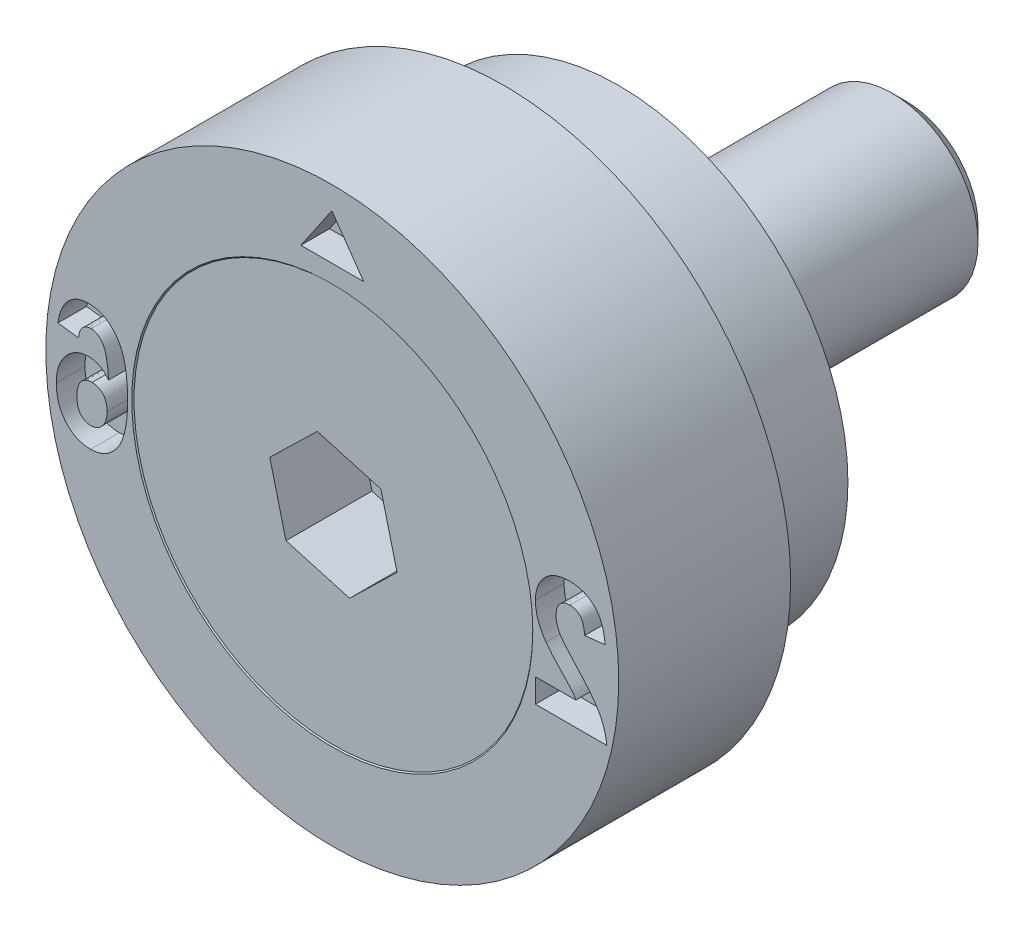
ISO-10303-21;
HEADER;
FILE_DESCRIPTION(('STEP AP214'),'2;1');
FILE_NAME('part.step','',(''),(''),'','','');
FILE_SCHEMA(('AUTOMOTIVE_DESIGN { 1 0 10303 214 1 1 1 1 }'));
ENDSEC;
DATA;
#1=APPLICATION_CONTEXT('core data for automotive mechanical design processes');
#2=APPLICATION_PROTOCOL_DEFINITION('international standard','automotive_design',2000,#1);
#3=PRODUCT_CONTEXT('',#1,'mechanical');
#4=PRODUCT('Part','Part','',(#3));
#5=PRODUCT_RELATED_PRODUCT_CATEGORY('part','',(#4));
#6=PRODUCT_DEFINITION_FORMATION('','',#4);
#7=PRODUCT_DEFINITION_CONTEXT('part definition',#1,'design');
#8=PRODUCT_DEFINITION('design','',#6,#7);
#9=PRODUCT_DEFINITION_SHAPE('','',#8);
#10=(LENGTH_UNIT() NAMED_UNIT(*) SI_UNIT(.MILLI.,.METRE.));
#11=(NAMED_UNIT(*) PLANE_ANGLE_UNIT() SI_UNIT($,.RADIAN.));
#12=(NAMED_UNIT(*) SI_UNIT($,.STERADIAN.) SOLID_ANGLE_UNIT());
#13=UNCERTAINTY_MEASURE_WITH_UNIT(LENGTH_MEASURE(1.E-05),#10,'distance_accuracy_value','');
#14=(GEOMETRIC_REPRESENTATION_CONTEXT(3) GLOBAL_UNCERTAINTY_ASSIGNED_CONTEXT((#13)) GLOBAL_UNIT_ASSIGNED_CONTEXT((#10,
#11,#12)) REPRESENTATION_CONTEXT('',''));
#15=CARTESIAN_POINT('',(0.,0.,0.));
#16=DIRECTION('',(0.,0.,1.));
#17=DIRECTION('',(1.,0.,0.));
#18=AXIS2_PLACEMENT_3D('',#15,#16,#17);
#19=CARTESIAN_POINT('',(0.,0.,-0.0200000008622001));
#20=DIRECTION('',(0.,0.,1.));
#21=DIRECTION('',(1.,0.,0.));
#22=AXIS2_PLACEMENT_3D('',#19,#20,#21);
#23=CYLINDRICAL_SURFACE('',#22,1.5);
#24=CARTESIAN_POINT('',(0.,0.,-2.0000000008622));
#25=DIRECTION('',(0.,0.,1.));
#26=DIRECTION('',(1.,0.,0.));
#27=AXIS2_PLACEMENT_3D('',#24,#25,#26);
#28=CIRCLE('',#27,1.5);
#29=CARTESIAN_POINT('',(1.5,0.,-2.0000000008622));
#30=VERTEX_POINT('',#29);
#31=EDGE_CURVE('E12',#30,#30,#28,.T.);
#32=ORIENTED_EDGE('',*,*,#31,.F.);
#33=EDGE_LOOP('',(#32));
#34=FACE_BOUND('',#33,.T.);
#35=CARTESIAN_POINT('',(0.,0.,-9.7700000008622));
#36=DIRECTION('',(0.,0.,1.));
#37=DIRECTION('',(1.,0.,0.));
#38=AXIS2_PLACEMENT_3D('',#35,#36,#37);
#39=CIRCLE('',#38,1.5);
#40=CARTESIAN_POINT('',(1.5,0.,-9.7700000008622));
#41=VERTEX_POINT('',#40);
#42=EDGE_CURVE('E152',#41,#41,#39,.T.);
#43=ORIENTED_EDGE('',*,*,#42,.T.);
#44=EDGE_LOOP('',(#43));
#45=FACE_BOUND('',#44,.T.);
#46=ADVANCED_FACE('F51',(#34,#45),#23,.T.);
#47=CARTESIAN_POINT('',(0.,0.,-2.0000000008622));
#48=DIRECTION('',(0.,0.,1.));
#49=DIRECTION('',(1.,0.,0.));
#50=AXIS2_PLACEMENT_3D('',#47,#48,#49);
#51=CONICAL_SURFACE('',#50,1.5,0.785398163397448);
#52=CARTESIAN_POINT('',(0.,0.,-0.0200000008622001));
#53=DIRECTION('',(0.,0.,1.));
#54=DIRECTION('',(1.,0.,0.));
#55=AXIS2_PLACEMENT_3D('',#52,#53,#54);
#56=CIRCLE('',#55,3.48);
#57=CARTESIAN_POINT('',(3.48,0.,-0.0200000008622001));
#58=VERTEX_POINT('',#57);
#59=EDGE_CURVE('E58',#58,#58,#56,.T.);
#60=ORIENTED_EDGE('',*,*,#59,.F.);
#61=EDGE_LOOP('',(#60));
#62=FACE_BOUND('',#61,.T.);
#63=ORIENTED_EDGE('',*,*,#31,.T.);
#64=EDGE_LOOP('',(#63));
#65=FACE_BOUND('',#64,.T.);
#66=ADVANCED_FACE('F167',(#62,#65),#51,.T.);
#67=CARTESIAN_POINT('',(0.,3.48,-0.0200000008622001));
#68=DIRECTION('',(0.,0.,-1.));
#69=DIRECTION('',(-1.,0.,0.));
#70=AXIS2_PLACEMENT_3D('',#67,#68,#69);
#71=PLANE('',#70);
#72=DIRECTION('',(0.962144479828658,-0.272539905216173,0.));
#73=VECTOR('',#72,1.);
#74=CARTESIAN_POINT('',(-0.828034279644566,-0.804793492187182,-0.0200000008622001));
#75=LINE('',#74,#73);
#76=CARTESIAN_POINT('',(-0.828034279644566,-0.804793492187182,-0.0200000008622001));
#77=VERTEX_POINT('',#76);
#78=CARTESIAN_POINT('',(0.282954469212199,-1.11949546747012,-0.0200000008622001));
#79=VERTEX_POINT('',#78);
#80=EDGE_CURVE('E139',#77,#79,#75,.T.);
#81=ORIENTED_EDGE('',*,*,#80,.F.);
#82=DIRECTION('',(0.245045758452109,-0.969511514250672,0.));
#83=VECTOR('',#82,1.);
#84=CARTESIAN_POINT('',(-1.11098874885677,0.314701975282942,-0.0200000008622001));
#85=LINE('',#84,#83);
#86=CARTESIAN_POINT('',(-1.11098874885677,0.314701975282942,-0.0200000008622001));
#87=VERTEX_POINT('',#86);
#88=EDGE_CURVE('E65',#87,#77,#85,.T.);
#89=ORIENTED_EDGE('',*,*,#88,.F.);
#90=DIRECTION('',(-0.717098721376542,-0.696971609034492,0.));
#91=VECTOR('',#90,1.);
#92=CARTESIAN_POINT('',(-0.282954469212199,1.11949546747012,-0.0200000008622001));
#93=LINE('',#92,#91);
#94=CARTESIAN_POINT('',(-0.282954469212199,1.11949546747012,-0.0200000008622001));
#95=VERTEX_POINT('',#94);
#96=EDGE_CURVE('E148',#95,#87,#93,.T.);
#97=ORIENTED_EDGE('',*,*,#96,.F.);
#98=DIRECTION('',(-0.962144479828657,0.272539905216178,0.));
#99=VECTOR('',#98,1.);
#100=CARTESIAN_POINT('',(0.828034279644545,0.804793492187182,-0.0200000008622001));
#101=LINE('',#100,#99);
#102=CARTESIAN_POINT('',(0.828034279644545,0.804793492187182,-0.0200000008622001));
#103=VERTEX_POINT('',#102);
#104=EDGE_CURVE('E146',#103,#95,#101,.T.);
#105=ORIENTED_EDGE('',*,*,#104,.F.);
#106=DIRECTION('',(-0.245045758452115,0.96951151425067,0.));
#107=VECTOR('',#106,1.);
#108=CARTESIAN_POINT('',(1.11098874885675,-0.314701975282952,-0.0200000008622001));
#109=LINE('',#108,#107);
#110=CARTESIAN_POINT('',(1.11098874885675,-0.314701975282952,-0.0200000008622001));
#111=VERTEX_POINT('',#110);
#112=EDGE_CURVE('E113',#111,#103,#109,.T.);
#113=ORIENTED_EDGE('',*,*,#112,.F.);
#114=DIRECTION('',(0.717098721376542,0.696971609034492,0.));
#115=VECTOR('',#114,1.);
#116=CARTESIAN_POINT('',(0.282954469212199,-1.11949546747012,-0.0200000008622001));
#117=LINE('',#116,#115);
#118=EDGE_CURVE('E142',#79,#111,#117,.T.);
#119=ORIENTED_EDGE('',*,*,#118,.F.);
#120=EDGE_LOOP('',(#81,#89,#97,#105,#113,#119));
#121=FACE_BOUND('',#120,.T.);
#122=ORIENTED_EDGE('',*,*,#59,.T.);
#123=EDGE_LOOP('',(#122));
#124=FACE_BOUND('',#123,.T.);
#125=ADVANCED_FACE('F165',(#121,#124),#71,.F.);
#126=CARTESIAN_POINT('',(0.,0.,-10.0200000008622));
#127=DIRECTION('',(0.,0.,1.));
#128=DIRECTION('',(1.,0.,0.));
#129=AXIS2_PLACEMENT_3D('',#126,#127,#128);
#130=PLANE('',#129);
#131=CARTESIAN_POINT('',(0.,0.,-10.0200000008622));
#132=DIRECTION('',(0.,0.,1.));
#133=DIRECTION('',(1.,0.,0.));
#134=AXIS2_PLACEMENT_3D('',#131,#132,#133);
#135=CIRCLE('',#134,1.25);
#136=CARTESIAN_POINT('',(1.25,0.,-10.0200000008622));
#137=VERTEX_POINT('',#136);
#138=EDGE_CURVE('E160',#137,#137,#135,.T.);
#139=ORIENTED_EDGE('',*,*,#138,.F.);
#140=EDGE_LOOP('',(#139));
#141=FACE_BOUND('',#140,.T.);
#142=ADVANCED_FACE('F180',(#141),#130,.F.);
#143=CARTESIAN_POINT('',(0.,0.,-10.0200000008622));
#144=DIRECTION('',(0.,0.,1.));
#145=DIRECTION('',(1.,0.,0.));
#146=AXIS2_PLACEMENT_3D('',#143,#144,#145);
#147=CONICAL_SURFACE('',#146,1.25,0.78539816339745);
#148=ORIENTED_EDGE('',*,*,#42,.F.);
#149=EDGE_LOOP('',(#148));
#150=FACE_BOUND('',#149,.T.);
#151=ORIENTED_EDGE('',*,*,#138,.T.);
#152=EDGE_LOOP('',(#151));
#153=FACE_BOUND('',#152,.T.);
#154=ADVANCED_FACE('F176',(#150,#153),#147,.T.);
#155=CARTESIAN_POINT('',(-1.11098874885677,0.314701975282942,-1.5200000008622));
#156=DIRECTION('',(-0.969511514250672,-0.245045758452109,0.));
#157=DIRECTION('',(0.245045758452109,-0.969511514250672,0.));
#158=AXIS2_PLACEMENT_3D('',#155,#156,#157);
#159=PLANE('',#158);
#160=ORIENTED_EDGE('',*,*,#88,.T.);
#161=DIRECTION('',(0.,0.,1.));
#162=VECTOR('',#161,1.);
#163=CARTESIAN_POINT('',(-0.828034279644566,-0.804793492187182,-1.5200000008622));
#164=LINE('',#163,#162);
#165=CARTESIAN_POINT('',(-0.828034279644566,-0.804793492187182,-1.5200000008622));
#166=VERTEX_POINT('',#165);
#167=EDGE_CURVE('E95',#166,#77,#164,.T.);
#168=ORIENTED_EDGE('',*,*,#167,.F.);
#169=DIRECTION('',(0.245045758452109,-0.969511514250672,0.));
#170=VECTOR('',#169,1.);
#171=CARTESIAN_POINT('',(-1.11098874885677,0.314701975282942,-1.5200000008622));
#172=LINE('',#171,#170);
#173=CARTESIAN_POINT('',(-1.11098874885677,0.314701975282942,-1.5200000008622));
#174=VERTEX_POINT('',#173);
#175=EDGE_CURVE('E150',#174,#166,#172,.T.);
#176=ORIENTED_EDGE('',*,*,#175,.F.);
#177=DIRECTION('',(0.,0.,1.));
#178=VECTOR('',#177,1.);
#179=CARTESIAN_POINT('',(-1.11098874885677,0.314701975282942,-1.5200000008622));
#180=LINE('',#179,#178);
#181=EDGE_CURVE('E73',#174,#87,#180,.T.);
#182=ORIENTED_EDGE('',*,*,#181,.T.);
#183=EDGE_LOOP('',(#160,#168,#176,#182));
#184=FACE_BOUND('',#183,.T.);
#185=ADVANCED_FACE('F179',(#184),#159,.F.);
#186=CARTESIAN_POINT('',(-0.282954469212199,1.11949546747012,-1.5200000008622));
#187=DIRECTION('',(-0.696971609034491,0.717098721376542,0.));
#188=DIRECTION('',(-0.717098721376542,-0.696971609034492,0.));
#189=AXIS2_PLACEMENT_3D('',#186,#187,#188);
#190=PLANE('',#189);
#191=ORIENTED_EDGE('',*,*,#96,.T.);
#192=ORIENTED_EDGE('',*,*,#181,.F.);
#193=DIRECTION('',(-0.717098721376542,-0.696971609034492,0.));
#194=VECTOR('',#193,1.);
#195=CARTESIAN_POINT('',(-0.282954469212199,1.11949546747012,-1.5200000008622));
#196=LINE('',#195,#194);
#197=CARTESIAN_POINT('',(-0.282954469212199,1.11949546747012,-1.5200000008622));
#198=VERTEX_POINT('',#197);
#199=EDGE_CURVE('E125',#198,#174,#196,.T.);
#200=ORIENTED_EDGE('',*,*,#199,.F.);
#201=DIRECTION('',(0.,0.,1.));
#202=VECTOR('',#201,1.);
#203=CARTESIAN_POINT('',(-0.282954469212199,1.11949546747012,-1.5200000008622));
#204=LINE('',#203,#202);
#205=EDGE_CURVE('E117',#198,#95,#204,.T.);
#206=ORIENTED_EDGE('',*,*,#205,.T.);
#207=EDGE_LOOP('',(#191,#192,#200,#206));
#208=FACE_BOUND('',#207,.T.);
#209=ADVANCED_FACE('F194',(#208),#190,.F.);
#210=CARTESIAN_POINT('',(0.828034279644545,0.804793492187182,-1.5200000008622));
#211=DIRECTION('',(0.272539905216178,0.962144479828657,0.));
#212=DIRECTION('',(-0.962144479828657,0.272539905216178,0.));
#213=AXIS2_PLACEMENT_3D('',#210,#211,#212);
#214=PLANE('',#213);
#215=ORIENTED_EDGE('',*,*,#104,.T.);
#216=ORIENTED_EDGE('',*,*,#205,.F.);
#217=DIRECTION('',(-0.962144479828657,0.272539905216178,0.));
#218=VECTOR('',#217,1.);
#219=CARTESIAN_POINT('',(0.828034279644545,0.804793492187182,-1.5200000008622));
#220=LINE('',#219,#218);
#221=CARTESIAN_POINT('',(0.828034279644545,0.804793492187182,-1.5200000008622));
#222=VERTEX_POINT('',#221);
#223=EDGE_CURVE('E121',#222,#198,#220,.T.);
#224=ORIENTED_EDGE('',*,*,#223,.F.);
#225=DIRECTION('',(0.,0.,1.));
#226=VECTOR('',#225,1.);
#227=CARTESIAN_POINT('',(0.828034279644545,0.804793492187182,-1.5200000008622));
#228=LINE('',#227,#226);
#229=EDGE_CURVE('E106',#222,#103,#228,.T.);
#230=ORIENTED_EDGE('',*,*,#229,.T.);
#231=EDGE_LOOP('',(#215,#216,#224,#230));
#232=FACE_BOUND('',#231,.T.);
#233=ADVANCED_FACE('F122',(#232),#214,.F.);
#234=CARTESIAN_POINT('',(1.11098874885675,-0.314701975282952,-1.5200000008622));
#235=DIRECTION('',(0.96951151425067,0.245045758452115,0.));
#236=DIRECTION('',(-0.245045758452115,0.96951151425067,0.));
#237=AXIS2_PLACEMENT_3D('',#234,#235,#236);
#238=PLANE('',#237);
#239=ORIENTED_EDGE('',*,*,#112,.T.);
#240=ORIENTED_EDGE('',*,*,#229,.F.);
#241=DIRECTION('',(-0.245045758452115,0.96951151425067,0.));
#242=VECTOR('',#241,1.);
#243=CARTESIAN_POINT('',(1.11098874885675,-0.314701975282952,-1.5200000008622));
#244=LINE('',#243,#242);
#245=CARTESIAN_POINT('',(1.11098874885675,-0.314701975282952,-1.5200000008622));
#246=VERTEX_POINT('',#245);
#247=EDGE_CURVE('E110',#246,#222,#244,.T.);
#248=ORIENTED_EDGE('',*,*,#247,.F.);
#249=DIRECTION('',(0.,0.,1.));
#250=VECTOR('',#249,1.);
#251=CARTESIAN_POINT('',(1.11098874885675,-0.314701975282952,-1.5200000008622));
#252=LINE('',#251,#250);
#253=EDGE_CURVE('E118',#246,#111,#252,.T.);
#254=ORIENTED_EDGE('',*,*,#253,.T.);
#255=EDGE_LOOP('',(#239,#240,#248,#254));
#256=FACE_BOUND('',#255,.T.);
#257=ADVANCED_FACE('F108',(#256),#238,.F.);
#258=CARTESIAN_POINT('',(0.282954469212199,-1.11949546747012,-1.5200000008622));
#259=DIRECTION('',(0.696971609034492,-0.717098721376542,0.));
#260=DIRECTION('',(0.717098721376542,0.696971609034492,0.));
#261=AXIS2_PLACEMENT_3D('',#258,#259,#260);
#262=PLANE('',#261);
#263=ORIENTED_EDGE('',*,*,#118,.T.);
#264=ORIENTED_EDGE('',*,*,#253,.F.);
#265=DIRECTION('',(0.717098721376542,0.696971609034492,0.));
#266=VECTOR('',#265,1.);
#267=CARTESIAN_POINT('',(0.282954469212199,-1.11949546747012,-1.5200000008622));
#268=LINE('',#267,#266);
#269=CARTESIAN_POINT('',(0.282954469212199,-1.11949546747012,-1.5200000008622));
#270=VERTEX_POINT('',#269);
#271=EDGE_CURVE('E131',#270,#246,#268,.T.);
#272=ORIENTED_EDGE('',*,*,#271,.F.);
#273=DIRECTION('',(0.,0.,1.));
#274=VECTOR('',#273,1.);
#275=CARTESIAN_POINT('',(0.282954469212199,-1.11949546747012,-1.5200000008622));
#276=LINE('',#275,#274);
#277=EDGE_CURVE('E155',#270,#79,#276,.T.);
#278=ORIENTED_EDGE('',*,*,#277,.T.);
#279=EDGE_LOOP('',(#263,#264,#272,#278));
#280=FACE_BOUND('',#279,.T.);
#281=ADVANCED_FACE('F198',(#280),#262,.F.);
#282=CARTESIAN_POINT('',(-0.828034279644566,-0.804793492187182,-1.5200000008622));
#283=DIRECTION('',(-0.272539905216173,-0.962144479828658,0.));
#284=DIRECTION('',(0.962144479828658,-0.272539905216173,0.));
#285=AXIS2_PLACEMENT_3D('',#282,#283,#284);
#286=PLANE('',#285);
#287=ORIENTED_EDGE('',*,*,#80,.T.);
#288=ORIENTED_EDGE('',*,*,#277,.F.);
#289=DIRECTION('',(0.962144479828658,-0.272539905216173,0.));
#290=VECTOR('',#289,1.);
#291=CARTESIAN_POINT('',(-0.828034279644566,-0.804793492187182,-1.5200000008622));
#292=LINE('',#291,#290);
#293=EDGE_CURVE('E133',#166,#270,#292,.T.);
#294=ORIENTED_EDGE('',*,*,#293,.F.);
#295=ORIENTED_EDGE('',*,*,#167,.T.);
#296=EDGE_LOOP('',(#287,#288,#294,#295));
#297=FACE_BOUND('',#296,.T.);
#298=ADVANCED_FACE('F195',(#297),#286,.F.);
#299=CARTESIAN_POINT('',(0.,0.,-1.5200000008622));
#300=DIRECTION('',(0.,0.,1.));
#301=DIRECTION('',(1.,0.,0.));
#302=AXIS2_PLACEMENT_3D('',#299,#300,#301);
#303=PLANE('',#302);
#304=ORIENTED_EDGE('',*,*,#175,.T.);
#305=ORIENTED_EDGE('',*,*,#293,.T.);
#306=ORIENTED_EDGE('',*,*,#271,.T.);
#307=ORIENTED_EDGE('',*,*,#247,.T.);
#308=ORIENTED_EDGE('',*,*,#223,.T.);
#309=ORIENTED_EDGE('',*,*,#199,.T.);
#310=EDGE_LOOP('',(#304,#305,#306,#307,#308,#309));
#311=FACE_BOUND('',#310,.T.);
#312=ADVANCED_FACE('F128',(#311),#303,.T.);
#313=CLOSED_SHELL('',(#46,#66,#125,#142,#154,#185,#209,#233,#257,#281,#298,#312));
#314=MANIFOLD_SOLID_BREP('B2',#313);
#315=CARTESIAN_POINT('',(0.,5.,0.));
#316=DIRECTION('',(0.,0.,-1.));
#317=DIRECTION('',(-1.,0.,0.));
#318=AXIS2_PLACEMENT_3D('',#315,#316,#317);
#319=PLANE('',#318);
#320=DIRECTION('',(0.,-1.,0.));
#321=VECTOR('',#320,1.);
#322=CARTESIAN_POINT('',(3.54590512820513,-0.664307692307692,0.));
#323=LINE('',#322,#321);
#324=CARTESIAN_POINT('',(3.54590512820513,-0.664307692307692,0.));
#325=VERTEX_POINT('',#324);
#326=CARTESIAN_POINT('',(3.54590512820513,-1.0795,0.));
#327=VERTEX_POINT('',#326);
#328=EDGE_CURVE('E694',#325,#327,#323,.T.);
#329=ORIENTED_EDGE('',*,*,#328,.F.);
#330=DIRECTION('',(-1.,0.,0.));
#331=VECTOR('',#330,1.);
#332=CARTESIAN_POINT('',(4.25129955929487,-0.664307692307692,0.));
#333=LINE('',#332,#331);
#334=CARTESIAN_POINT('',(4.25129955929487,-0.664307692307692,0.));
#335=VERTEX_POINT('',#334);
#336=EDGE_CURVE('E325',#335,#325,#333,.T.);
#337=ORIENTED_EDGE('',*,*,#336,.F.);
#338=CARTESIAN_POINT('',(3.72928173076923,-0.0493040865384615,0.));
#339=CARTESIAN_POINT('',(3.73495702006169,-0.0575885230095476,0.));
#340=CARTESIAN_POINT('',(3.74713707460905,-0.0753682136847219,0.));
#341=CARTESIAN_POINT('',(3.76857080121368,-0.102241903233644,0.));
#342=CARTESIAN_POINT('',(3.79272897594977,-0.132254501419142,0.));
#343=CARTESIAN_POINT('',(3.82047705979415,-0.164654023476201,0.));
#344=CARTESIAN_POINT('',(3.8516914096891,-0.199493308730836,0.));
#345=CARTESIAN_POINT('',(3.88566781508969,-0.237429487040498,0.));
#346=CARTESIAN_POINT('',(3.92413300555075,-0.276858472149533,0.));
#347=CARTESIAN_POINT('',(3.96379371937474,-0.318778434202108,0.));
#348=CARTESIAN_POINT('',(4.00411888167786,-0.359207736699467,0.));
#349=CARTESIAN_POINT('',(4.04066877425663,-0.397899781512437,0.));
#350=CARTESIAN_POINT('',(4.07374382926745,-0.432449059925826,0.));
#351=CARTESIAN_POINT('',(4.10259897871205,-0.46356105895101,0.));
#352=CARTESIAN_POINT('',(4.12765750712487,-0.490831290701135,0.));
#353=CARTESIAN_POINT('',(4.14903626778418,-0.514038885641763,0.));
#354=CARTESIAN_POINT('',(4.16599827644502,-0.534002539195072,0.));
#355=CARTESIAN_POINT('',(4.18993262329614,-0.564473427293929,0.));
#356=CARTESIAN_POINT('',(4.22005774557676,-0.606317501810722,0.));
#357=CARTESIAN_POINT('',(4.24115605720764,-0.645479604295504,0.));
#358=CARTESIAN_POINT('',(4.25129955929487,-0.664307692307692,0.));
#359=B_SPLINE_CURVE_WITH_KNOTS('',3,(#338,#339,#340,#341,#342,#343,#344,#345,#346,#347,#348,
#349,#350,#351,#352,#353,#354,#355,#356,#357,#358),.UNSPECIFIED.,.F.,.F.,(4,1,1,1,1,1,1,1,1,1,1,
1,1,1,1,1,1,1,4),(0.,0.0372293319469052,0.0798999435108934,0.127410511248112,0.180123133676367,
0.238064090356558,0.30089248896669,0.368957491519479,0.442313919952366,0.514902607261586,
0.580699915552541,0.639694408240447,0.692276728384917,0.738059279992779,0.777043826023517,
0.809286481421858,0.835170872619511,0.920754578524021,1.),.UNSPECIFIED.);
#360=CARTESIAN_POINT('',(3.72928173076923,-0.0493040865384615,0.));
#361=VERTEX_POINT('',#360);
#362=EDGE_CURVE('E522',#361,#335,#359,.T.);
#363=ORIENTED_EDGE('',*,*,#362,.F.);
#364=CARTESIAN_POINT('',(3.54590512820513,0.492175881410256,0.));
#365=CARTESIAN_POINT('',(3.54636144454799,0.468652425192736,0.));
#366=CARTESIAN_POINT('',(3.54726574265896,0.422035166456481,0.));
#367=CARTESIAN_POINT('',(3.55578515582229,0.353026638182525,0.));
#368=CARTESIAN_POINT('',(3.56952147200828,0.28572181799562,0.));
#369=CARTESIAN_POINT('',(3.58941862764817,0.219724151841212,0.));
#370=CARTESIAN_POINT('',(3.61470659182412,0.153730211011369,0.));
#371=CARTESIAN_POINT('',(3.64670046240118,0.0869824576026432,0.));
#372=CARTESIAN_POINT('',(3.6846299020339,0.0185238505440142,0.));
#373=CARTESIAN_POINT('',(3.71412621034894,-0.0262822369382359,0.));
#374=CARTESIAN_POINT('',(3.72928173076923,-0.0493040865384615,0.));
#375=B_SPLINE_CURVE_WITH_KNOTS('',3,(#364,#365,#366,#367,#368,#369,#370,#371,#372,#373,#374),
.UNSPECIFIED.,.F.,.F.,(4,1,1,1,1,1,1,1,4),(0.,0.121430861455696,0.240643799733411,
0.358470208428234,0.475770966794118,0.596193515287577,0.723070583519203,0.857710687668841,1.),.UNSPECIFIED.);
#376=CARTESIAN_POINT('',(3.54590512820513,0.492175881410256,0.));
#377=VERTEX_POINT('',#376);
#378=EDGE_CURVE('E525',#377,#361,#375,.T.);
#379=ORIENTED_EDGE('',*,*,#378,.F.);
#380=CARTESIAN_POINT('',(4.14058161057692,1.0795,0.));
#381=CARTESIAN_POINT('',(4.11807179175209,1.0790159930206,0.));
#382=CARTESIAN_POINT('',(4.07420815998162,1.07807283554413,0.));
#383=CARTESIAN_POINT('',(4.0101485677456,1.07031647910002,0.));
#384=CARTESIAN_POINT('',(3.9499007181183,1.05665872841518,0.));
#385=CARTESIAN_POINT('',(3.89293876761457,1.03897597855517,0.));
#386=CARTESIAN_POINT('',(3.84018317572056,1.01471131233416,0.));
#387=CARTESIAN_POINT('',(3.79083577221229,0.985702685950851,0.));
#388=CARTESIAN_POINT('',(3.7454673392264,0.950914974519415,0.));
#389=CARTESIAN_POINT('',(3.70394646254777,0.911550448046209,0.));
#390=CARTESIAN_POINT('',(3.66695414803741,0.868328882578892,0.));
#391=CARTESIAN_POINT('',(3.63426850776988,0.822434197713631,0.));
#392=CARTESIAN_POINT('',(3.60685929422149,0.773725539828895,0.));
#393=CARTESIAN_POINT('',(3.58477841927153,0.722333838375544,0.));
#394=CARTESIAN_POINT('',(3.56744484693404,0.668456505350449,0.));
#395=CARTESIAN_POINT('',(3.55484224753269,0.612024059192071,0.));
#396=CARTESIAN_POINT('',(3.54744971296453,0.552921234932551,0.));
#397=CARTESIAN_POINT('',(3.54642618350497,0.512667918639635,0.));
#398=CARTESIAN_POINT('',(3.54590512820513,0.492175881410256,0.));
#399=B_SPLINE_CURVE_WITH_KNOTS('',3,(#380,#381,#382,#383,#384,#385,#386,#387,#388,#389,#390,
#391,#392,#393,#394,#395,#396,#397,#398),.UNSPECIFIED.,.F.,.F.,(4,1,1,1,1,1,1,1,1,1,1,1,1,1,1,1,
4),(0.,0.0718026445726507,0.139917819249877,0.205419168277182,0.268691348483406,
0.329822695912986,0.390243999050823,0.450956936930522,0.511795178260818,0.572457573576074,
0.632179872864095,0.69128264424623,0.750406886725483,0.81033250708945,0.871593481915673,
0.934631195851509,1.),.UNSPECIFIED.);
#400=CARTESIAN_POINT('',(4.14058161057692,1.0795,0.));
#401=VERTEX_POINT('',#400);
#402=EDGE_CURVE('E1334',#401,#377,#399,.T.);
#403=ORIENTED_EDGE('',*,*,#402,.F.);
#404=CARTESIAN_POINT('',(4.76380256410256,0.428167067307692,0.));
#405=CARTESIAN_POINT('',(4.76091261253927,0.456195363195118,0.));
#406=CARTESIAN_POINT('',(4.75531282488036,0.510505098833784,0.));
#407=CARTESIAN_POINT('',(4.74020726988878,0.588427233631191,0.));
#408=CARTESIAN_POINT('',(4.72207189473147,0.660439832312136,0.));
#409=CARTESIAN_POINT('',(4.69897073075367,0.726256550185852,0.));
#410=CARTESIAN_POINT('',(4.6720197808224,0.786137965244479,0.));
#411=CARTESIAN_POINT('',(4.64033428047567,0.839625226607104,0.));
#412=CARTESIAN_POINT('',(4.60456496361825,0.887142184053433,0.));
#413=CARTESIAN_POINT('',(4.56418022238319,0.928272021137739,0.));
#414=CARTESIAN_POINT('',(4.52000154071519,0.963638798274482,0.));
#415=CARTESIAN_POINT('',(4.47383982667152,0.995113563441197,0.));
#416=CARTESIAN_POINT('',(4.42457376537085,1.02112544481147,0.));
#417=CARTESIAN_POINT('',(4.37278599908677,1.04225059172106,0.));
#418=CARTESIAN_POINT('',(4.3186382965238,1.05945401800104,0.));
#419=CARTESIAN_POINT('',(4.26146497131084,1.07073256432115,0.));
#420=CARTESIAN_POINT('',(4.20192387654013,1.0785478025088,0.));
#421=CARTESIAN_POINT('',(4.16122350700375,1.07917958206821,0.));
#422=CARTESIAN_POINT('',(4.14058161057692,1.0795,0.));
#423=B_SPLINE_CURVE_WITH_KNOTS('',3,(#404,#405,#406,#407,#408,#409,#410,#411,#412,#413,#414,
#415,#416,#417,#418,#419,#420,#421,#422),.UNSPECIFIED.,.F.,.F.,(4,1,1,1,1,1,1,1,1,1,1,1,1,1,1,1,
4),(0.,0.0836347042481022,0.162056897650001,0.235468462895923,0.30397920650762,
0.368923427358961,0.430156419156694,0.488208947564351,0.545123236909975,0.600818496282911,
0.656031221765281,0.710804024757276,0.765898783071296,0.821956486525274,0.879217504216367,
0.938743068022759,1.),.UNSPECIFIED.);
#424=CARTESIAN_POINT('',(4.76380256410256,0.428167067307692,0.));
#425=VERTEX_POINT('',#424);
#426=EDGE_CURVE('E1329',#425,#401,#423,.T.);
#427=ORIENTED_EDGE('',*,*,#426,.F.);
#428=DIRECTION('',(0.993678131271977,0.112266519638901,0.));
#429=VECTOR('',#428,1.);
#430=CARTESIAN_POINT('',(4.40396923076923,0.38751282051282,0.));
#431=LINE('',#430,#429);
#432=CARTESIAN_POINT('',(4.40396923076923,0.38751282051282,0.));
#433=VERTEX_POINT('',#432);
#434=EDGE_CURVE('E1323',#433,#425,#431,.T.);
#435=ORIENTED_EDGE('',*,*,#434,.F.);
#436=CARTESIAN_POINT('',(4.14836646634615,0.719666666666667,0.));
#437=CARTESIAN_POINT('',(4.16619861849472,0.718826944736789,0.));
#438=CARTESIAN_POINT('',(4.2006142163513,0.717206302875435,0.));
#439=CARTESIAN_POINT('',(4.24956105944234,0.702569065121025,0.));
#440=CARTESIAN_POINT('',(4.29245028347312,0.677651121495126,0.));
#441=CARTESIAN_POINT('',(4.32310874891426,0.64935495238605,0.));
#442=CARTESIAN_POINT('',(4.34373644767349,0.621784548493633,0.));
#443=CARTESIAN_POINT('',(4.35756691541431,0.597588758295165,0.));
#444=CARTESIAN_POINT('',(4.37016263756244,0.570483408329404,0.));
#445=CARTESIAN_POINT('',(4.38033883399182,0.539948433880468,0.));
#446=CARTESIAN_POINT('',(4.38903869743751,0.506430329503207,0.));
#447=CARTESIAN_POINT('',(4.39578619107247,0.46970636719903,0.));
#448=CARTESIAN_POINT('',(4.40104547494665,0.429720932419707,0.));
#449=CARTESIAN_POINT('',(4.40296960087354,0.40194374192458,0.));
#450=CARTESIAN_POINT('',(4.40396923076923,0.38751282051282,0.));
#451=B_SPLINE_CURVE_WITH_KNOTS('',3,(#436,#437,#438,#439,#440,#441,#442,#443,#444,#445,#446,
#447,#448,#449,#450),.UNSPECIFIED.,.F.,.F.,(4,1,1,1,1,1,1,1,1,1,1,1,4),(0.,0.113180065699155,
0.218434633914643,0.321087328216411,0.426146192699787,0.481136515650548,0.539455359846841,
0.603018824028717,0.670840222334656,0.743752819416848,0.823023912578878,0.908056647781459,1.),.UNSPECIFIED.);
#452=CARTESIAN_POINT('',(4.14836646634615,0.719666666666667,0.));
#453=VERTEX_POINT('',#452);
#454=EDGE_CURVE('E1303',#453,#433,#451,.T.);
#455=ORIENTED_EDGE('',*,*,#454,.F.);
#456=CARTESIAN_POINT('',(3.90573846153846,0.436384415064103,0.));
#457=CARTESIAN_POINT('',(3.9063543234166,0.457927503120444,0.));
#458=CARTESIAN_POINT('',(3.90751883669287,0.498662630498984,0.));
#459=CARTESIAN_POINT('',(3.91964174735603,0.555966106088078,0.));
#460=CARTESIAN_POINT('',(3.94001444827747,0.605377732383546,0.));
#461=CARTESIAN_POINT('',(3.96830805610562,0.647064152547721,0.));
#462=CARTESIAN_POINT('',(4.00456346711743,0.679337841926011,0.));
#463=CARTESIAN_POINT('',(4.0466711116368,0.703835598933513,0.));
#464=CARTESIAN_POINT('',(4.09586169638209,0.716912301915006,0.));
#465=CARTESIAN_POINT('',(4.13042090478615,0.718725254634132,0.));
#466=CARTESIAN_POINT('',(4.14836646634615,0.719666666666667,0.));
#467=B_SPLINE_CURVE_WITH_KNOTS('',3,(#456,#457,#458,#459,#460,#461,#462,#463,#464,#465,#466),
.UNSPECIFIED.,.F.,.F.,(4,1,1,1,1,1,1,1,4),(0.,0.152713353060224,0.288760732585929,
0.413023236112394,0.52994305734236,0.642943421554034,0.754737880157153,0.87264272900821,1.),.UNSPECIFIED.);
#468=CARTESIAN_POINT('',(3.90573846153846,0.436384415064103,0.));
#469=VERTEX_POINT('',#468);
#470=EDGE_CURVE('E1301',#469,#453,#467,.T.);
#471=ORIENTED_EDGE('',*,*,#470,.F.);
#472=CARTESIAN_POINT('',(3.97882960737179,0.186836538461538,0.));
#473=CARTESIAN_POINT('',(3.96764516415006,0.207642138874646,0.));
#474=CARTESIAN_POINT('',(3.94597589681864,0.247951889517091,0.));
#475=CARTESIAN_POINT('',(3.92275645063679,0.310981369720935,0.));
#476=CARTESIAN_POINT('',(3.90879838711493,0.373779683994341,0.));
#477=CARTESIAN_POINT('',(3.90674932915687,0.415702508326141,0.));
#478=CARTESIAN_POINT('',(3.90573846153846,0.436384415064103,0.));
#479=B_SPLINE_CURVE_WITH_KNOTS('',3,(#472,#473,#474,#475,#476,#477,#478),.UNSPECIFIED.,.F.,.F.,
(4,1,1,1,4),(0.,0.269282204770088,0.52172003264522,0.764048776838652,1.),.UNSPECIFIED.);
#480=CARTESIAN_POINT('',(3.97882960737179,0.186836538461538,0.));
#481=VERTEX_POINT('',#480);
#482=EDGE_CURVE('E1294',#481,#469,#479,.T.);
#483=ORIENTED_EDGE('',*,*,#482,.F.);
#484=CARTESIAN_POINT('',(4.27249166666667,-0.161752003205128,0.));
#485=CARTESIAN_POINT('',(4.25343205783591,-0.141164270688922,0.));
#486=CARTESIAN_POINT('',(4.21717778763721,-0.102003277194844,0.));
#487=CARTESIAN_POINT('',(4.16584537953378,-0.0456234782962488,0.));
#488=CARTESIAN_POINT('',(4.12053193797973,0.00579456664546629,0.));
#489=CARTESIAN_POINT('',(4.08082044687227,0.0518765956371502,0.));
#490=CARTESIAN_POINT('',(4.04676749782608,0.0926941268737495,0.));
#491=CARTESIAN_POINT('',(4.01868585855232,0.128383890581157,0.));
#492=CARTESIAN_POINT('',(3.99633559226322,0.15904648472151,0.));
#493=CARTESIAN_POINT('',(3.98422326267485,0.178274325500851,0.));
#494=CARTESIAN_POINT('',(3.97882960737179,0.186836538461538,0.));
#495=B_SPLINE_CURVE_WITH_KNOTS('',3,(#484,#485,#486,#487,#488,#489,#490,#491,#492,#493,#494),
.UNSPECIFIED.,.F.,.F.,(4,1,1,1,1,1,1,1,4),(0.,0.184436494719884,0.350826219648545,
0.501230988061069,0.634967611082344,0.750729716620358,0.850641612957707,0.933490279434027,1.),.UNSPECIFIED.);
#496=CARTESIAN_POINT('',(4.27249166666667,-0.161752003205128,0.));
#497=VERTEX_POINT('',#496);
#498=EDGE_CURVE('E1286',#497,#481,#495,.T.);
#499=ORIENTED_EDGE('',*,*,#498,.F.);
#500=CARTESIAN_POINT('',(4.79148205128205,-1.0795,0.));
#501=CARTESIAN_POINT('',(4.78719712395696,-1.04404631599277,0.));
#502=CARTESIAN_POINT('',(4.77864999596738,-0.973326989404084,0.));
#503=CARTESIAN_POINT('',(4.75224640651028,-0.869792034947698,0.));
#504=CARTESIAN_POINT('',(4.71734264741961,-0.768685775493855,0.));
#505=CARTESIAN_POINT('',(4.67897002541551,-0.686507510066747,0.));
#506=CARTESIAN_POINT('',(4.64170417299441,-0.619669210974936,0.));
#507=CARTESIAN_POINT('',(4.60678877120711,-0.565795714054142,0.));
#508=CARTESIAN_POINT('',(4.56605985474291,-0.507839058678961,0.));
#509=CARTESIAN_POINT('',(4.51922121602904,-0.446037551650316,0.));
#510=CARTESIAN_POINT('',(4.46637936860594,-0.380322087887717,0.));
#511=CARTESIAN_POINT('',(4.40745032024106,-0.310754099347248,0.));
#512=CARTESIAN_POINT('',(4.34258179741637,-0.237063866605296,0.));
#513=CARTESIAN_POINT('',(4.29640279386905,-0.187444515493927,0.));
#514=CARTESIAN_POINT('',(4.27249166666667,-0.161752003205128,0.));
#515=B_SPLINE_CURVE_WITH_KNOTS('',3,(#500,#501,#502,#503,#504,#505,#506,#507,#508,#509,#510,
#511,#512,#513,#514),.UNSPECIFIED.,.F.,.F.,(4,1,1,1,1,1,1,1,1,1,1,1,4),(0.,0.0994452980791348,
0.198363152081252,0.297103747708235,0.397237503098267,0.450667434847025,0.510300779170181,
0.576071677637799,0.648078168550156,0.72639487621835,0.811079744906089,0.9021785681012,1.),.UNSPECIFIED.);
#516=CARTESIAN_POINT('',(4.79148205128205,-1.0795,0.));
#517=VERTEX_POINT('',#516);
#518=EDGE_CURVE('E1295',#517,#497,#515,.T.);
#519=ORIENTED_EDGE('',*,*,#518,.F.);
#520=DIRECTION('',(1.,0.,0.));
#521=VECTOR('',#520,1.);
#522=CARTESIAN_POINT('',(3.54590512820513,-1.0795,0.));
#523=LINE('',#522,#521);
#524=EDGE_CURVE('E1402',#327,#517,#523,.T.);
#525=ORIENTED_EDGE('',*,*,#524,.F.);
#526=EDGE_LOOP('',(#329,#337,#363,#379,#403,#427,#435,#455,#471,#483,#499,#519,#525));
#527=FACE_BOUND('',#526,.T.);
#528=DIRECTION('',(0.992130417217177,-0.125208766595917,0.));
#529=VECTOR('',#528,1.);
#530=CARTESIAN_POINT('',(-4.78894205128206,0.515962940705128,0.));
#531=LINE('',#530,#529);
#532=CARTESIAN_POINT('',(-4.78894205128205,0.515962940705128,0.));
#533=VERTEX_POINT('',#532);
#534=CARTESIAN_POINT('',(-4.42910871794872,0.470551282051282,0.));
#535=VERTEX_POINT('',#534);
#536=EDGE_CURVE('E699',#533,#535,#531,.T.);
#537=ORIENTED_EDGE('',*,*,#536,.F.);
#538=CARTESIAN_POINT('',(-4.25654441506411,1.0795,0.));
#539=CARTESIAN_POINT('',(-4.27401472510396,1.0791491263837,0.));
#540=CARTESIAN_POINT('',(-4.30823468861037,1.07846185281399,0.));
#541=CARTESIAN_POINT('',(-4.35844984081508,1.07113968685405,0.));
#542=CARTESIAN_POINT('',(-4.40641672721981,1.06007947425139,0.));
#543=CARTESIAN_POINT('',(-4.45219238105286,1.04454338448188,0.));
#544=CARTESIAN_POINT('',(-4.49538136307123,1.02398759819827,0.));
#545=CARTESIAN_POINT('',(-4.53613886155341,0.998714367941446,0.));
#546=CARTESIAN_POINT('',(-4.57476896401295,0.969118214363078,0.));
#547=CARTESIAN_POINT('',(-4.61119593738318,0.935436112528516,0.));
#548=CARTESIAN_POINT('',(-4.64461459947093,0.89711848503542,0.));
#549=CARTESIAN_POINT('',(-4.67481248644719,0.854553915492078,0.));
#550=CARTESIAN_POINT('',(-4.70218495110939,0.808190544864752,0.));
#551=CARTESIAN_POINT('',(-4.72598298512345,0.757586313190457,0.));
#552=CARTESIAN_POINT('',(-4.7466027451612,0.703021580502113,0.));
#553=CARTESIAN_POINT('',(-4.76445141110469,0.644415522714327,0.));
#554=CARTESIAN_POINT('',(-4.77861270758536,0.581635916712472,0.));
#555=CARTESIAN_POINT('',(-4.7854431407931,0.538208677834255,0.));
#556=CARTESIAN_POINT('',(-4.78894205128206,0.515962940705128,0.));
#557=B_SPLINE_CURVE_WITH_KNOTS('',3,(#538,#539,#540,#541,#542,#543,#544,#545,#546,#547,#548,
#549,#550,#551,#552,#553,#554,#555,#556),.UNSPECIFIED.,.F.,.F.,(4,1,1,1,1,1,1,1,1,1,1,1,1,1,1,1,
4),(0.,0.0611751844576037,0.119826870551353,0.177416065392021,0.233487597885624,
0.288846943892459,0.344642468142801,0.401221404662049,0.459126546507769,0.518194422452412,
0.579030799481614,0.64175475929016,0.706604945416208,0.774715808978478,0.845986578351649,
0.921106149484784,1.),.UNSPECIFIED.);
#558=CARTESIAN_POINT('',(-4.25654441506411,1.0795,0.));
#559=VERTEX_POINT('',#558);
#560=EDGE_CURVE('E333',#559,#533,#557,.T.);
#561=ORIENTED_EDGE('',*,*,#560,.F.);
#562=CARTESIAN_POINT('',(-3.57104461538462,-0.0289769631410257,0.));
#563=CARTESIAN_POINT('',(-3.57157141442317,0.0183257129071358,0.));
#564=CARTESIAN_POINT('',(-3.57258912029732,0.109708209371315,0.));
#565=CARTESIAN_POINT('',(-3.58187371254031,0.241628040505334,0.));
#566=CARTESIAN_POINT('',(-3.59611290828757,0.363426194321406,0.));
#567=CARTESIAN_POINT('',(-3.61666128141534,0.474897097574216,0.));
#568=CARTESIAN_POINT('',(-3.64325553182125,0.576231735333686,0.));
#569=CARTESIAN_POINT('',(-3.67600360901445,0.667325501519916,0.));
#570=CARTESIAN_POINT('',(-3.71417939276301,0.748599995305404,0.));
#571=CARTESIAN_POINT('',(-3.7592241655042,0.819216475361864,0.));
#572=CARTESIAN_POINT('',(-3.80884313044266,0.880601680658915,0.));
#573=CARTESIAN_POINT('',(-3.86216970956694,0.933772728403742,0.));
#574=CARTESIAN_POINT('',(-3.91929054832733,0.978643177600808,0.));
#575=CARTESIAN_POINT('',(-3.97956169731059,1.01593676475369,0.));
#576=CARTESIAN_POINT('',(-4.04389088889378,1.04412429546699,0.));
#577=CARTESIAN_POINT('',(-4.11153551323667,1.06449043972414,0.));
#578=CARTESIAN_POINT('',(-4.18280371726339,1.07759336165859,0.));
#579=CARTESIAN_POINT('',(-4.23169043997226,1.07885737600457,0.));
#580=CARTESIAN_POINT('',(-4.25654441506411,1.0795,0.));
#581=B_SPLINE_CURVE_WITH_KNOTS('',3,(#562,#563,#564,#565,#566,#567,#568,#569,#570,#571,#572,
#573,#574,#575,#576,#577,#578,#579,#580),.UNSPECIFIED.,.F.,.F.,(4,1,1,1,1,1,1,1,1,1,1,1,1,1,1,1,
4),(0.,0.0968769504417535,0.187153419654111,0.270734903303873,0.347936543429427,
0.41913311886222,0.485079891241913,0.545967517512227,0.602654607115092,0.656196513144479,
0.707353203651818,0.756561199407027,0.804672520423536,0.852134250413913,0.899962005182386,
0.949140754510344,1.),.UNSPECIFIED.);
#582=CARTESIAN_POINT('',(-3.57104461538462,-0.0289769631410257,0.));
#583=VERTEX_POINT('',#582);
#584=EDGE_CURVE('E629',#583,#559,#581,.T.);
#585=ORIENTED_EDGE('',*,*,#584,.F.);
#586=CARTESIAN_POINT('',(-4.21718764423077,-1.10717948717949,0.));
#587=CARTESIAN_POINT('',(-4.19407169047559,-1.10645725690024,0.));
#588=CARTESIAN_POINT('',(-4.14868701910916,-1.10503926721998,0.));
#589=CARTESIAN_POINT('',(-4.08221217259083,-1.09306712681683,0.));
#590=CARTESIAN_POINT('',(-4.01901628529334,-1.07304971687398,0.));
#591=CARTESIAN_POINT('',(-3.95902082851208,-1.04500829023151,0.));
#592=CARTESIAN_POINT('',(-3.90178490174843,-1.00988101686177,0.));
#593=CARTESIAN_POINT('',(-3.84823459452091,-0.966011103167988,0.));
#594=CARTESIAN_POINT('',(-3.79828584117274,-0.914102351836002,0.));
#595=CARTESIAN_POINT('',(-3.75044511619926,-0.855170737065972,0.));
#596=CARTESIAN_POINT('',(-3.70786273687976,-0.786370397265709,0.));
#597=CARTESIAN_POINT('',(-3.67074480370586,-0.707763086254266,0.));
#598=CARTESIAN_POINT('',(-3.63993439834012,-0.618920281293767,0.));
#599=CARTESIAN_POINT('',(-3.61454138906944,-0.520251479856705,0.));
#600=CARTESIAN_POINT('',(-3.59499662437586,-0.411524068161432,0.));
#601=CARTESIAN_POINT('',(-3.58083289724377,-0.292825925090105,0.));
#602=CARTESIAN_POINT('',(-3.57287498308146,-0.164167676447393,0.));
#603=CARTESIAN_POINT('',(-3.57166935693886,-0.0751202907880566,0.));
#604=CARTESIAN_POINT('',(-3.57104461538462,-0.0289769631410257,0.));
#605=B_SPLINE_CURVE_WITH_KNOTS('',3,(#586,#587,#588,#589,#590,#591,#592,#593,#594,#595,#596,
#597,#598,#599,#600,#601,#602,#603,#604),.UNSPECIFIED.,.F.,.F.,(4,1,1,1,1,1,1,1,1,1,1,1,1,1,1,1,
4),(0.,0.04920150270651,0.0965996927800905,0.143304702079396,0.190008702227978,
0.237296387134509,0.285966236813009,0.336988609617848,0.390499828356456,0.447322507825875,
0.508847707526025,0.575267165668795,0.647277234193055,0.725623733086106,0.810356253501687,
0.901728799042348,1.),.UNSPECIFIED.);
#606=CARTESIAN_POINT('',(-4.21718764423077,-1.10717948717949,0.));
#607=VERTEX_POINT('',#606);
#608=EDGE_CURVE('E785',#607,#583,#605,.T.);
#609=ORIENTED_EDGE('',*,*,#608,.F.);
#610=CARTESIAN_POINT('',(-4.81662153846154,-0.403082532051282,0.));
#611=CARTESIAN_POINT('',(-4.81614070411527,-0.429050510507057,0.));
#612=CARTESIAN_POINT('',(-4.81520346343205,-0.47966720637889,0.));
#613=CARTESIAN_POINT('',(-4.80739003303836,-0.553756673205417,0.));
#614=CARTESIAN_POINT('',(-4.79391780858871,-0.623692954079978,0.));
#615=CARTESIAN_POINT('',(-4.77589663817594,-0.690112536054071,0.));
#616=CARTESIAN_POINT('',(-4.75212158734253,-0.75240004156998,0.));
#617=CARTESIAN_POINT('',(-4.72298068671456,-0.810771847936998,0.));
#618=CARTESIAN_POINT('',(-4.6886673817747,-0.865129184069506,0.));
#619=CARTESIAN_POINT('',(-4.64946902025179,-0.915063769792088,0.));
#620=CARTESIAN_POINT('',(-4.60618415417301,-0.960165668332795,0.));
#621=CARTESIAN_POINT('',(-4.55961725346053,-0.99963970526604,0.));
#622=CARTESIAN_POINT('',(-4.50970079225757,-1.03272750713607,0.));
#623=CARTESIAN_POINT('',(-4.45728366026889,-1.06038313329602,0.));
#624=CARTESIAN_POINT('',(-4.40133204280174,-1.08099243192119,0.));
#625=CARTESIAN_POINT('',(-4.34269603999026,-1.09623835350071,0.));
#626=CARTESIAN_POINT('',(-4.2809145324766,-1.1055203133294,0.));
#627=CARTESIAN_POINT('',(-4.23870010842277,-1.10661939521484,0.));
#628=CARTESIAN_POINT('',(-4.21718764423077,-1.10717948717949,0.));
#629=B_SPLINE_CURVE_WITH_KNOTS('',3,(#610,#611,#612,#613,#614,#615,#616,#617,#618,#619,#620,
#621,#622,#623,#624,#625,#626,#627,#628),.UNSPECIFIED.,.F.,.F.,(4,1,1,1,1,1,1,1,1,1,1,1,1,1,1,1,
4),(0.,0.0750177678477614,0.146224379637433,0.214927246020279,0.280612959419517,
0.344820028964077,0.407223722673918,0.468817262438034,0.530228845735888,0.59032533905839,
0.64915109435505,0.706220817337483,0.763043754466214,0.819985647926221,0.878076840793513,
0.937867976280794,1.),.UNSPECIFIED.);
#630=CARTESIAN_POINT('',(-4.81662153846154,-0.403082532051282,0.));
#631=VERTEX_POINT('',#630);
#632=EDGE_CURVE('E793',#631,#607,#629,.T.);
#633=ORIENTED_EDGE('',*,*,#632,.F.);
#634=CARTESIAN_POINT('',(-4.25005703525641,0.276794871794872,0.));
#635=CARTESIAN_POINT('',(-4.2692607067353,0.276189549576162,0.));
#636=CARTESIAN_POINT('',(-4.30700205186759,0.274999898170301,0.));
#637=CARTESIAN_POINT('',(-4.36266762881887,0.266263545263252,0.));
#638=CARTESIAN_POINT('',(-4.41595593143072,0.250923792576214,0.));
#639=CARTESIAN_POINT('',(-4.46728877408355,0.230058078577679,0.));
#640=CARTESIAN_POINT('',(-4.51674002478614,0.203449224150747,0.));
#641=CARTESIAN_POINT('',(-4.56374676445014,0.170472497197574,0.));
#642=CARTESIAN_POINT('',(-4.60860888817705,0.13144985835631,0.));
#643=CARTESIAN_POINT('',(-4.65111657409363,0.0873546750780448,0.));
#644=CARTESIAN_POINT('',(-4.68973836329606,0.0383507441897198,0.));
#645=CARTESIAN_POINT('',(-4.72378780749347,-0.0144903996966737,0.));
#646=CARTESIAN_POINT('',(-4.75292229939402,-0.0707089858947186,0.));
#647=CARTESIAN_POINT('',(-4.77611047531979,-0.130696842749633,0.));
#648=CARTESIAN_POINT('',(-4.79448594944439,-0.193913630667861,0.));
#649=CARTESIAN_POINT('',(-4.8071986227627,-0.260523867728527,0.));
#650=CARTESIAN_POINT('',(-4.81524295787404,-0.330659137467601,0.));
#651=CARTESIAN_POINT('',(-4.8161545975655,-0.378551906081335,0.));
#652=CARTESIAN_POINT('',(-4.81662153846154,-0.403082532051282,0.));
#653=B_SPLINE_CURVE_WITH_KNOTS('',3,(#634,#635,#636,#637,#638,#639,#640,#641,#642,#643,#644,
#645,#646,#647,#648,#649,#650,#651,#652),.UNSPECIFIED.,.F.,.F.,(4,1,1,1,1,1,1,1,1,1,1,1,1,1,1,1,
4),(0.,0.0583907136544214,0.114756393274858,0.170822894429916,0.226672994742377,
0.282972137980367,0.341229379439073,0.400909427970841,0.46354383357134,0.527222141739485,
0.590338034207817,0.654457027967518,0.71942624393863,0.785610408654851,0.854396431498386,
0.925422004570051,1.),.UNSPECIFIED.);
#654=CARTESIAN_POINT('',(-4.25005703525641,0.276794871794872,0.));
#655=VERTEX_POINT('',#654);
#656=EDGE_CURVE('E801',#655,#631,#653,.T.);
#657=ORIENTED_EDGE('',*,*,#656,.F.);
#658=CARTESIAN_POINT('',(-3.90363095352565,0.0960132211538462,0.));
#659=CARTESIAN_POINT('',(-3.91530647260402,0.110398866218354,0.));
#660=CARTESIAN_POINT('',(-3.93810501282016,0.138489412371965,0.));
#661=CARTESIAN_POINT('',(-3.97647082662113,0.175426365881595,0.));
#662=CARTESIAN_POINT('',(-4.01681745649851,0.206666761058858,0.));
#663=CARTESIAN_POINT('',(-4.05904693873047,0.232845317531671,0.));
#664=CARTESIAN_POINT('',(-4.10398482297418,0.25198445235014,0.));
#665=CARTESIAN_POINT('',(-4.15066095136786,0.266783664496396,0.));
#666=CARTESIAN_POINT('',(-4.19975555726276,0.274838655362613,0.));
#667=CARTESIAN_POINT('',(-4.23316385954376,0.276137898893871,0.));
#668=CARTESIAN_POINT('',(-4.25005703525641,0.276794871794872,0.));
#669=B_SPLINE_CURVE_WITH_KNOTS('',3,(#658,#659,#660,#661,#662,#663,#664,#665,#666,#667,#668),
.UNSPECIFIED.,.F.,.F.,(4,1,1,1,1,1,1,1,4),(0.,0.136900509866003,0.267322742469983,
0.392698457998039,0.513725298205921,0.633544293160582,0.752907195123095,0.875055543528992,1.),.UNSPECIFIED.);
#670=CARTESIAN_POINT('',(-3.90363095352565,0.0960132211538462,0.));
#671=VERTEX_POINT('',#670);
#672=EDGE_CURVE('E809',#671,#655,#669,.T.);
#673=ORIENTED_EDGE('',*,*,#672,.F.);
#674=CARTESIAN_POINT('',(-4.21156524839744,0.719666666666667,0.));
#675=CARTESIAN_POINT('',(-4.20172694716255,0.719411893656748,0.));
#676=CARTESIAN_POINT('',(-4.18214408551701,0.718904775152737,0.));
#677=CARTESIAN_POINT('',(-4.15367994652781,0.712469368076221,0.));
#678=CARTESIAN_POINT('',(-4.12629139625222,0.702914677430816,0.));
#679=CARTESIAN_POINT('',(-4.10017168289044,0.689257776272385,0.));
#680=CARTESIAN_POINT('',(-4.07497193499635,0.671911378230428,0.));
#681=CARTESIAN_POINT('',(-4.05125515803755,0.650474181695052,0.));
#682=CARTESIAN_POINT('',(-4.02844200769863,0.625580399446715,0.));
#683=CARTESIAN_POINT('',(-4.00702682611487,0.596073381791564,0.));
#684=CARTESIAN_POINT('',(-3.98658496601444,0.560885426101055,0.));
#685=CARTESIAN_POINT('',(-3.9692620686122,0.517819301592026,0.));
#686=CARTESIAN_POINT('',(-3.95324348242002,0.467097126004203,0.));
#687=CARTESIAN_POINT('',(-3.94001859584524,0.408095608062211,0.));
#688=CARTESIAN_POINT('',(-3.92712056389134,0.341563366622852,0.));
#689=CARTESIAN_POINT('',(-3.91770942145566,0.266835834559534,0.));
#690=CARTESIAN_POINT('',(-3.90938645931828,0.184208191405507,0.));
#691=CARTESIAN_POINT('',(-3.90560764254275,0.126303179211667,0.));
#692=CARTESIAN_POINT('',(-3.90363095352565,0.0960132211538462,0.));
#693=B_SPLINE_CURVE_WITH_KNOTS('',3,(#674,#675,#676,#677,#678,#679,#680,#681,#682,#683,#684,
#685,#686,#687,#688,#689,#690,#691,#692),.UNSPECIFIED.,.F.,.F.,(4,1,1,1,1,1,1,1,1,1,1,1,1,1,1,1,
4),(0.,0.038553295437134,0.0767392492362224,0.113973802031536,0.152197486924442,
0.192074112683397,0.23376512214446,0.277433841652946,0.324413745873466,0.376643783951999,
0.436768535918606,0.506220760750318,0.585296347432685,0.673989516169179,0.772204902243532,
0.880840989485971,1.),.UNSPECIFIED.);
#694=CARTESIAN_POINT('',(-4.21156524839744,0.719666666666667,0.));
#695=VERTEX_POINT('',#694);
#696=EDGE_CURVE('E817',#695,#671,#693,.T.);
#697=ORIENTED_EDGE('',*,*,#696,.F.);
#698=CARTESIAN_POINT('',(-4.42910871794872,0.470551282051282,0.));
#699=CARTESIAN_POINT('',(-4.4264387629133,0.490539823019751,0.));
#700=CARTESIAN_POINT('',(-4.42142255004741,0.528093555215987,0.));
#701=CARTESIAN_POINT('',(-4.40678297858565,0.579913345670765,0.));
#702=CARTESIAN_POINT('',(-4.38666820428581,0.623721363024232,0.));
#703=CARTESIAN_POINT('',(-4.36025526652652,0.658911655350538,0.));
#704=CARTESIAN_POINT('',(-4.32949958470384,0.686577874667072,0.));
#705=CARTESIAN_POINT('',(-4.29399284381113,0.706022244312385,0.));
#706=CARTESIAN_POINT('',(-4.2540771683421,0.717545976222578,0.));
#707=CARTESIAN_POINT('',(-4.22605943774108,0.718943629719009,0.));
#708=CARTESIAN_POINT('',(-4.21156524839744,0.719666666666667,0.));
#709=B_SPLINE_CURVE_WITH_KNOTS('',3,(#698,#699,#700,#701,#702,#703,#704,#705,#706,#707,#708),
.UNSPECIFIED.,.F.,.F.,(4,1,1,1,1,1,1,1,4),(0.,0.164204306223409,0.308500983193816,
0.437274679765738,0.554779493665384,0.664657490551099,0.771941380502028,0.882020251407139,1.),.UNSPECIFIED.);
#710=EDGE_CURVE('E825',#535,#695,#709,.T.);
#711=ORIENTED_EDGE('',*,*,#710,.F.);
#712=EDGE_LOOP('',(#537,#561,#585,#609,#633,#657,#673,#697,#711));
#713=FACE_BOUND('',#712,.T.);
#714=CARTESIAN_POINT('',(0.,0.,0.));
#715=DIRECTION('',(0.,0.,1.));
#716=DIRECTION('',(1.,0.,0.));
#717=AXIS2_PLACEMENT_3D('',#714,#715,#716);
#718=CIRCLE('',#717,5.);
#719=CARTESIAN_POINT('',(5.,0.,0.));
#720=VERTEX_POINT('',#719);
#721=EDGE_CURVE('E49',#720,#720,#718,.T.);
#722=ORIENTED_EDGE('',*,*,#721,.T.);
#723=EDGE_LOOP('',(#722));
#724=FACE_BOUND('',#723,.T.);
#725=CARTESIAN_POINT('',(0.,0.,0.));
#726=DIRECTION('',(0.,0.,1.));
#727=DIRECTION('',(1.,0.,0.));
#728=AXIS2_PLACEMENT_3D('',#725,#726,#727);
#729=CIRCLE('',#728,3.5000000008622);
#730=CARTESIAN_POINT('',(3.5000000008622,0.,0.));
#731=VERTEX_POINT('',#730);
#732=EDGE_CURVE('E318',#731,#731,#729,.T.);
#733=ORIENTED_EDGE('',*,*,#732,.F.);
#734=EDGE_LOOP('',(#733));
#735=FACE_BOUND('',#734,.T.);
#736=DIRECTION('',(-0.573576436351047,0.819152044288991,0.));
#737=VECTOR('',#736,1.);
#738=CARTESIAN_POINT('',(0.548658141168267,3.81,0.));
#739=LINE('',#738,#737);
#740=CARTESIAN_POINT('',(0.548658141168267,3.81,0.));
#741=VERTEX_POINT('',#740);
#742=CARTESIAN_POINT('',(-0.00713159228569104,4.60375,0.));
#743=VERTEX_POINT('',#742);
#744=EDGE_CURVE('E709',#741,#743,#739,.T.);
#745=ORIENTED_EDGE('',*,*,#744,.F.);
#746=DIRECTION('',(1.,0.,0.));
#747=VECTOR('',#746,1.);
#748=CARTESIAN_POINT('',(-0.548658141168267,3.81,0.));
#749=LINE('',#748,#747);
#750=CARTESIAN_POINT('',(-0.548658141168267,3.81,0.));
#751=VERTEX_POINT('',#750);
#752=EDGE_CURVE('E710',#751,#741,#749,.T.);
#753=ORIENTED_EDGE('',*,*,#752,.F.);
#754=DIRECTION('',(-0.563573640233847,-0.826065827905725,0.));
#755=VECTOR('',#754,1.);
#756=CARTESIAN_POINT('',(-0.00713159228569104,4.60375,0.));
#757=LINE('',#756,#755);
#758=EDGE_CURVE('E712',#743,#751,#757,.T.);
#759=ORIENTED_EDGE('',*,*,#758,.F.);
#760=EDGE_LOOP('',(#745,#753,#759));
#761=FACE_BOUND('',#760,.T.);
#762=ADVANCED_FACE('F310',(#527,#713,#724,#735,#761),#319,.F.);
#763=CARTESIAN_POINT('',(0.,0.,3.12219627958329));
#764=DIRECTION('',(0.,0.,1.));
#765=DIRECTION('',(1.,0.,0.));
#766=AXIS2_PLACEMENT_3D('',#763,#764,#765);
#767=CYLINDRICAL_SURFACE('',#766,5.);
#768=ORIENTED_EDGE('',*,*,#721,.F.);
#769=EDGE_LOOP('',(#768));
#770=FACE_BOUND('',#769,.T.);
#771=CARTESIAN_POINT('',(0.,0.,-3.));
#772=DIRECTION('',(0.,0.,1.));
#773=DIRECTION('',(1.,0.,0.));
#774=AXIS2_PLACEMENT_3D('',#771,#772,#773);
#775=CIRCLE('',#774,5.);
#776=CARTESIAN_POINT('',(5.,0.,-3.));
#777=VERTEX_POINT('',#776);
#778=EDGE_CURVE('E723',#777,#777,#775,.T.);
#779=ORIENTED_EDGE('',*,*,#778,.T.);
#780=EDGE_LOOP('',(#779));
#781=FACE_BOUND('',#780,.T.);
#782=ADVANCED_FACE('F312',(#770,#781),#767,.T.);
#783=CARTESIAN_POINT('',(0.,0.,0.));
#784=DIRECTION('',(0.,0.,1.));
#785=DIRECTION('',(1.,0.,0.));
#786=AXIS2_PLACEMENT_3D('',#783,#784,#785);
#787=CONICAL_SURFACE('',#786,3.5000000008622,0.785398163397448);
#788=CARTESIAN_POINT('',(0.,0.,-2.0000000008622));
#789=DIRECTION('',(0.,0.,1.));
#790=DIRECTION('',(1.,0.,0.));
#791=AXIS2_PLACEMENT_3D('',#788,#789,#790);
#792=CIRCLE('',#791,1.5);
#793=CARTESIAN_POINT('',(1.5,0.,-2.0000000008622));
#794=VERTEX_POINT('',#793);
#795=EDGE_CURVE('E740',#794,#794,#792,.T.);
#796=ORIENTED_EDGE('',*,*,#795,.F.);
#797=EDGE_LOOP('',(#796));
#798=FACE_BOUND('',#797,.T.);
#799=ORIENTED_EDGE('',*,*,#732,.T.);
#800=EDGE_LOOP('',(#799));
#801=FACE_BOUND('',#800,.T.);
#802=ADVANCED_FACE('F674',(#798,#801),#787,.F.);
#803=CARTESIAN_POINT('',(0.,0.,3.12219627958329));
#804=DIRECTION('',(0.,0.,1.));
#805=DIRECTION('',(1.,0.,0.));
#806=AXIS2_PLACEMENT_3D('',#803,#804,#805);
#807=CYLINDRICAL_SURFACE('',#806,1.5);
#808=CARTESIAN_POINT('',(0.,0.,-5.));
#809=DIRECTION('',(0.,0.,1.));
#810=DIRECTION('',(1.,0.,0.));
#811=AXIS2_PLACEMENT_3D('',#808,#809,#810);
#812=CIRCLE('',#811,1.5);
#813=CARTESIAN_POINT('',(1.5,0.,-5.));
#814=VERTEX_POINT('',#813);
#815=EDGE_CURVE('E737',#814,#814,#812,.T.);
#816=ORIENTED_EDGE('',*,*,#815,.F.);
#817=EDGE_LOOP('',(#816));
#818=FACE_BOUND('',#817,.T.);
#819=ORIENTED_EDGE('',*,*,#795,.T.);
#820=EDGE_LOOP('',(#819));
#821=FACE_BOUND('',#820,.T.);
#822=ADVANCED_FACE('F670',(#818,#821),#807,.F.);
#823=CARTESIAN_POINT('',(0.,1.5,-5.));
#824=DIRECTION('',(0.,0.,1.));
#825=DIRECTION('',(1.,0.,0.));
#826=AXIS2_PLACEMENT_3D('',#823,#824,#825);
#827=PLANE('',#826);
#828=CARTESIAN_POINT('',(0.,0.,-5.));
#829=DIRECTION('',(0.,0.,1.));
#830=DIRECTION('',(1.,0.,0.));
#831=AXIS2_PLACEMENT_3D('',#828,#829,#830);
#832=CIRCLE('',#831,4.);
#833=CARTESIAN_POINT('',(4.,0.,-5.));
#834=VERTEX_POINT('',#833);
#835=EDGE_CURVE('E734',#834,#834,#832,.T.);
#836=ORIENTED_EDGE('',*,*,#835,.F.);
#837=EDGE_LOOP('',(#836));
#838=FACE_BOUND('',#837,.T.);
#839=ORIENTED_EDGE('',*,*,#815,.T.);
#840=EDGE_LOOP('',(#839));
#841=FACE_BOUND('',#840,.T.);
#842=ADVANCED_FACE('F666',(#838,#841),#827,.F.);
#843=CARTESIAN_POINT('',(0.,0.,3.12219627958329));
#844=DIRECTION('',(0.,0.,1.));
#845=DIRECTION('',(1.,0.,0.));
#846=AXIS2_PLACEMENT_3D('',#843,#844,#845);
#847=CYLINDRICAL_SURFACE('',#846,4.);
#848=CARTESIAN_POINT('',(0.,0.,-3.));
#849=DIRECTION('',(0.,0.,1.));
#850=DIRECTION('',(1.,0.,0.));
#851=AXIS2_PLACEMENT_3D('',#848,#849,#850);
#852=CIRCLE('',#851,4.);
#853=CARTESIAN_POINT('',(4.,0.,-3.));
#854=VERTEX_POINT('',#853);
#855=EDGE_CURVE('E731',#854,#854,#852,.T.);
#856=ORIENTED_EDGE('',*,*,#855,.F.);
#857=EDGE_LOOP('',(#856));
#858=FACE_BOUND('',#857,.T.);
#859=ORIENTED_EDGE('',*,*,#835,.T.);
#860=EDGE_LOOP('',(#859));
#861=FACE_BOUND('',#860,.T.);
#862=ADVANCED_FACE('F662',(#858,#861),#847,.T.);
#863=CARTESIAN_POINT('',(0.,4.,-3.));
#864=DIRECTION('',(0.,0.,1.));
#865=DIRECTION('',(1.,0.,0.));
#866=AXIS2_PLACEMENT_3D('',#863,#864,#865);
#867=PLANE('',#866);
#868=ORIENTED_EDGE('',*,*,#778,.F.);
#869=EDGE_LOOP('',(#868));
#870=FACE_BOUND('',#869,.T.);
#871=ORIENTED_EDGE('',*,*,#855,.T.);
#872=EDGE_LOOP('',(#871));
#873=FACE_BOUND('',#872,.T.);
#874=ADVANCED_FACE('F658',(#870,#873),#867,.F.);
#875=CARTESIAN_POINT('',(-0.548658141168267,3.81,-0.5));
#876=DIRECTION('',(0.,-1.,0.));
#877=DIRECTION('',(0.,0.,-1.));
#878=AXIS2_PLACEMENT_3D('',#875,#876,#877);
#879=PLANE('',#878);
#880=ORIENTED_EDGE('',*,*,#752,.T.);
#881=DIRECTION('',(0.,0.,1.));
#882=VECTOR('',#881,1.);
#883=CARTESIAN_POINT('',(0.548658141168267,3.81,-0.5));
#884=LINE('',#883,#882);
#885=CARTESIAN_POINT('',(0.548658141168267,3.81,-0.5));
#886=VERTEX_POINT('',#885);
#887=EDGE_CURVE('E726',#886,#741,#884,.T.);
#888=ORIENTED_EDGE('',*,*,#887,.F.);
#889=DIRECTION('',(1.,0.,0.));
#890=VECTOR('',#889,1.);
#891=CARTESIAN_POINT('',(-0.548658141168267,3.81,-0.5));
#892=LINE('',#891,#890);
#893=CARTESIAN_POINT('',(-0.548658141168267,3.81,-0.5));
#894=VERTEX_POINT('',#893);
#895=EDGE_CURVE('E715',#894,#886,#892,.T.);
#896=ORIENTED_EDGE('',*,*,#895,.F.);
#897=DIRECTION('',(0.,0.,1.));
#898=VECTOR('',#897,1.);
#899=CARTESIAN_POINT('',(-0.548658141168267,3.81,-0.5));
#900=LINE('',#899,#898);
#901=EDGE_CURVE('E721',#894,#751,#900,.T.);
#902=ORIENTED_EDGE('',*,*,#901,.T.);
#903=EDGE_LOOP('',(#880,#888,#896,#902));
#904=FACE_BOUND('',#903,.T.);
#905=ADVANCED_FACE('F651',(#904),#879,.F.);
#906=CARTESIAN_POINT('',(-0.00713159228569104,4.60375,-0.5));
#907=DIRECTION('',(-0.826065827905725,0.563573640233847,0.));
#908=DIRECTION('',(-0.563573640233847,-0.826065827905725,0.));
#909=AXIS2_PLACEMENT_3D('',#906,#907,#908);
#910=PLANE('',#909);
#911=ORIENTED_EDGE('',*,*,#758,.T.);
#912=ORIENTED_EDGE('',*,*,#901,.F.);
#913=DIRECTION('',(-0.563573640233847,-0.826065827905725,0.));
#914=VECTOR('',#913,1.);
#915=CARTESIAN_POINT('',(-0.00713159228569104,4.60375,-0.5));
#916=LINE('',#915,#914);
#917=CARTESIAN_POINT('',(-0.00713159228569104,4.60375,-0.5));
#918=VERTEX_POINT('',#917);
#919=EDGE_CURVE('E728',#918,#894,#916,.T.);
#920=ORIENTED_EDGE('',*,*,#919,.F.);
#921=DIRECTION('',(0.,0.,1.));
#922=VECTOR('',#921,1.);
#923=CARTESIAN_POINT('',(-0.00713159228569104,4.60375,-0.5));
#924=LINE('',#923,#922);
#925=EDGE_CURVE('E724',#918,#743,#924,.T.);
#926=ORIENTED_EDGE('',*,*,#925,.T.);
#927=EDGE_LOOP('',(#911,#912,#920,#926));
#928=FACE_BOUND('',#927,.T.);
#929=ADVANCED_FACE('F648',(#928),#910,.F.);
#930=CARTESIAN_POINT('',(0.548658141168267,3.81,-0.5));
#931=DIRECTION('',(0.819152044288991,0.573576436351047,0.));
#932=DIRECTION('',(-0.573576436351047,0.819152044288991,0.));
#933=AXIS2_PLACEMENT_3D('',#930,#931,#932);
#934=PLANE('',#933);
#935=ORIENTED_EDGE('',*,*,#744,.T.);
#936=ORIENTED_EDGE('',*,*,#925,.F.);
#937=DIRECTION('',(-0.573576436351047,0.819152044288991,0.));
#938=VECTOR('',#937,1.);
#939=CARTESIAN_POINT('',(0.548658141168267,3.81,-0.5));
#940=LINE('',#939,#938);
#941=EDGE_CURVE('E755',#886,#918,#940,.T.);
#942=ORIENTED_EDGE('',*,*,#941,.F.);
#943=ORIENTED_EDGE('',*,*,#887,.T.);
#944=EDGE_LOOP('',(#935,#936,#942,#943));
#945=FACE_BOUND('',#944,.T.);
#946=ADVANCED_FACE('F646',(#945),#934,.F.);
#947=CARTESIAN_POINT('',(-0.548658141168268,3.81,-0.5));
#948=DIRECTION('',(0.,0.,-1.));
#949=DIRECTION('',(-1.,0.,0.));
#950=AXIS2_PLACEMENT_3D('',#947,#948,#949);
#951=PLANE('',#950);
#952=ORIENTED_EDGE('',*,*,#895,.T.);
#953=ORIENTED_EDGE('',*,*,#941,.T.);
#954=ORIENTED_EDGE('',*,*,#919,.T.);
#955=EDGE_LOOP('',(#952,#953,#954));
#956=FACE_BOUND('',#955,.T.);
#957=ADVANCED_FACE('F643',(#956),#951,.F.);
#958=CARTESIAN_POINT('',(-4.63378650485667,0.909074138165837,-0.5));
#959=DIRECTION('',(0.,0.,-1.));
#960=DIRECTION('',(-1.,0.,0.));
#961=AXIS2_PLACEMENT_3D('',#958,#959,#960);
#962=PLANE('',#961);
#963=CARTESIAN_POINT('',(-4.25654441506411,1.0795,-0.5));
#964=CARTESIAN_POINT('',(-4.27401472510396,1.0791491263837,-0.5));
#965=CARTESIAN_POINT('',(-4.30823468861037,1.07846185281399,-0.5));
#966=CARTESIAN_POINT('',(-4.35844984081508,1.07113968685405,-0.5));
#967=CARTESIAN_POINT('',(-4.40641672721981,1.06007947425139,-0.5));
#968=CARTESIAN_POINT('',(-4.45219238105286,1.04454338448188,-0.5));
#969=CARTESIAN_POINT('',(-4.49538136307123,1.02398759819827,-0.5));
#970=CARTESIAN_POINT('',(-4.53613886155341,0.998714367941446,-0.5));
#971=CARTESIAN_POINT('',(-4.57476896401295,0.969118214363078,-0.5));
#972=CARTESIAN_POINT('',(-4.61119593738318,0.935436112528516,-0.5));
#973=CARTESIAN_POINT('',(-4.64461459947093,0.89711848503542,-0.5));
#974=CARTESIAN_POINT('',(-4.67481248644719,0.854553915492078,-0.5));
#975=CARTESIAN_POINT('',(-4.70218495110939,0.808190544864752,-0.5));
#976=CARTESIAN_POINT('',(-4.72598298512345,0.757586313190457,-0.5));
#977=CARTESIAN_POINT('',(-4.7466027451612,0.703021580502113,-0.5));
#978=CARTESIAN_POINT('',(-4.76445141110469,0.644415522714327,-0.5));
#979=CARTESIAN_POINT('',(-4.77861270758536,0.581635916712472,-0.5));
#980=CARTESIAN_POINT('',(-4.7854431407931,0.538208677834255,-0.5));
#981=CARTESIAN_POINT('',(-4.78894205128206,0.515962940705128,-0.5));
#982=B_SPLINE_CURVE_WITH_KNOTS('',3,(#963,#964,#965,#966,#967,#968,#969,#970,#971,#972,#973,
#974,#975,#976,#977,#978,#979,#980,#981),.UNSPECIFIED.,.F.,.F.,(4,1,1,1,1,1,1,1,1,1,1,1,1,1,1,1,
4),(0.,0.0611751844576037,0.119826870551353,0.177416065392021,0.233487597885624,
0.288846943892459,0.344642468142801,0.401221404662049,0.459126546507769,0.518194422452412,
0.579030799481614,0.64175475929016,0.706604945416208,0.774715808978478,0.845986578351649,
0.921106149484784,1.),.UNSPECIFIED.);
#983=CARTESIAN_POINT('',(-4.25654441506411,1.0795,-0.5));
#984=VERTEX_POINT('',#983);
#985=CARTESIAN_POINT('',(-4.78894205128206,0.515962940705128,-0.5));
#986=VERTEX_POINT('',#985);
#987=EDGE_CURVE('E622',#984,#986,#982,.T.);
#988=ORIENTED_EDGE('',*,*,#987,.T.);
#989=DIRECTION('',(0.992130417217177,-0.125208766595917,0.));
#990=VECTOR('',#989,1.);
#991=CARTESIAN_POINT('',(-4.78894205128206,0.515962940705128,-0.5));
#992=LINE('',#991,#990);
#993=CARTESIAN_POINT('',(-4.42910871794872,0.470551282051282,-0.5));
#994=VERTEX_POINT('',#993);
#995=EDGE_CURVE('E628',#986,#994,#992,.T.);
#996=ORIENTED_EDGE('',*,*,#995,.T.);
#997=CARTESIAN_POINT('',(-4.42910871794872,0.470551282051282,-0.5));
#998=CARTESIAN_POINT('',(-4.4264387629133,0.490539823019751,-0.5));
#999=CARTESIAN_POINT('',(-4.42142255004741,0.528093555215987,-0.5));
#1000=CARTESIAN_POINT('',(-4.40678297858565,0.579913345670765,-0.5));
#1001=CARTESIAN_POINT('',(-4.38666820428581,0.623721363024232,-0.5));
#1002=CARTESIAN_POINT('',(-4.36025526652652,0.658911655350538,-0.5));
#1003=CARTESIAN_POINT('',(-4.32949958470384,0.686577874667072,-0.5));
#1004=CARTESIAN_POINT('',(-4.29399284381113,0.706022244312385,-0.5));
#1005=CARTESIAN_POINT('',(-4.2540771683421,0.717545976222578,-0.5));
#1006=CARTESIAN_POINT('',(-4.22605943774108,0.718943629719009,-0.5));
#1007=CARTESIAN_POINT('',(-4.21156524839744,0.719666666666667,-0.5));
#1008=B_SPLINE_CURVE_WITH_KNOTS('',3,(#997,#998,#999,#1000,#1001,#1002,#1003,#1004,#1005,#1006,
#1007),.UNSPECIFIED.,.F.,.F.,(4,1,1,1,1,1,1,1,4),(0.,0.164204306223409,0.308500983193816,
0.437274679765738,0.554779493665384,0.664657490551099,0.771941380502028,0.882020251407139,1.),.UNSPECIFIED.);
#1009=CARTESIAN_POINT('',(-4.21156524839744,0.719666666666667,-0.5));
#1010=VERTEX_POINT('',#1009);
#1011=EDGE_CURVE('E913',#994,#1010,#1008,.T.);
#1012=ORIENTED_EDGE('',*,*,#1011,.T.);
#1013=CARTESIAN_POINT('',(-4.21156524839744,0.719666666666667,-0.5));
#1014=CARTESIAN_POINT('',(-4.20172694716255,0.719411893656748,-0.5));
#1015=CARTESIAN_POINT('',(-4.18214408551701,0.718904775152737,-0.5));
#1016=CARTESIAN_POINT('',(-4.15367994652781,0.712469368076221,-0.5));
#1017=CARTESIAN_POINT('',(-4.12629139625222,0.702914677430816,-0.5));
#1018=CARTESIAN_POINT('',(-4.10017168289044,0.689257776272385,-0.5));
#1019=CARTESIAN_POINT('',(-4.07497193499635,0.671911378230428,-0.5));
#1020=CARTESIAN_POINT('',(-4.05125515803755,0.650474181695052,-0.5));
#1021=CARTESIAN_POINT('',(-4.02844200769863,0.625580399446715,-0.5));
#1022=CARTESIAN_POINT('',(-4.00702682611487,0.596073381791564,-0.5));
#1023=CARTESIAN_POINT('',(-3.98658496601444,0.560885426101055,-0.5));
#1024=CARTESIAN_POINT('',(-3.9692620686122,0.517819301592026,-0.5));
#1025=CARTESIAN_POINT('',(-3.95324348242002,0.467097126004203,-0.5));
#1026=CARTESIAN_POINT('',(-3.94001859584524,0.408095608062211,-0.5));
#1027=CARTESIAN_POINT('',(-3.92712056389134,0.341563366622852,-0.5));
#1028=CARTESIAN_POINT('',(-3.91770942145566,0.266835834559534,-0.5));
#1029=CARTESIAN_POINT('',(-3.90938645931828,0.184208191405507,-0.5));
#1030=CARTESIAN_POINT('',(-3.90560764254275,0.126303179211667,-0.5));
#1031=CARTESIAN_POINT('',(-3.90363095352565,0.0960132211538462,-0.5));
#1032=B_SPLINE_CURVE_WITH_KNOTS('',3,(#1013,#1014,#1015,#1016,#1017,#1018,#1019,#1020,#1021,
#1022,#1023,#1024,#1025,#1026,#1027,#1028,#1029,#1030,#1031),.UNSPECIFIED.,.F.,.F.,(4,1,1,1,1,1,
1,1,1,1,1,1,1,1,1,1,4),(0.,0.038553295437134,0.0767392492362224,0.113973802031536,
0.152197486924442,0.192074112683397,0.23376512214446,0.277433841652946,0.324413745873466,
0.376643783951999,0.436768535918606,0.506220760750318,0.585296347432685,0.673989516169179,
0.772204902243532,0.880840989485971,1.),.UNSPECIFIED.);
#1033=CARTESIAN_POINT('',(-3.90363095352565,0.0960132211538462,-0.5));
#1034=VERTEX_POINT('',#1033);
#1035=EDGE_CURVE('E896',#1010,#1034,#1032,.T.);
#1036=ORIENTED_EDGE('',*,*,#1035,.T.);
#1037=CARTESIAN_POINT('',(-3.90363095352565,0.0960132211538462,-0.5));
#1038=CARTESIAN_POINT('',(-3.91530647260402,0.110398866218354,-0.5));
#1039=CARTESIAN_POINT('',(-3.93810501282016,0.138489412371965,-0.5));
#1040=CARTESIAN_POINT('',(-3.97647082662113,0.175426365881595,-0.5));
#1041=CARTESIAN_POINT('',(-4.01681745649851,0.206666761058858,-0.5));
#1042=CARTESIAN_POINT('',(-4.05904693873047,0.232845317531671,-0.5));
#1043=CARTESIAN_POINT('',(-4.10398482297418,0.25198445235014,-0.5));
#1044=CARTESIAN_POINT('',(-4.15066095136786,0.266783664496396,-0.5));
#1045=CARTESIAN_POINT('',(-4.19975555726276,0.274838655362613,-0.5));
#1046=CARTESIAN_POINT('',(-4.23316385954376,0.276137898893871,-0.5));
#1047=CARTESIAN_POINT('',(-4.25005703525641,0.276794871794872,-0.5));
#1048=B_SPLINE_CURVE_WITH_KNOTS('',3,(#1037,#1038,#1039,#1040,#1041,#1042,#1043,#1044,#1045,
#1046,#1047),.UNSPECIFIED.,.F.,.F.,(4,1,1,1,1,1,1,1,4),(0.,0.136900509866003,0.267322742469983,
0.392698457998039,0.513725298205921,0.633544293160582,0.752907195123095,0.875055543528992,1.),.UNSPECIFIED.);
#1049=CARTESIAN_POINT('',(-4.25005703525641,0.276794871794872,-0.5));
#1050=VERTEX_POINT('',#1049);
#1051=EDGE_CURVE('E887',#1034,#1050,#1048,.T.);
#1052=ORIENTED_EDGE('',*,*,#1051,.T.);
#1053=CARTESIAN_POINT('',(-4.25005703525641,0.276794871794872,-0.5));
#1054=CARTESIAN_POINT('',(-4.2692607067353,0.276189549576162,-0.5));
#1055=CARTESIAN_POINT('',(-4.30700205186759,0.274999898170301,-0.5));
#1056=CARTESIAN_POINT('',(-4.36266762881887,0.266263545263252,-0.5));
#1057=CARTESIAN_POINT('',(-4.41595593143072,0.250923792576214,-0.5));
#1058=CARTESIAN_POINT('',(-4.46728877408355,0.230058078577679,-0.5));
#1059=CARTESIAN_POINT('',(-4.51674002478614,0.203449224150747,-0.5));
#1060=CARTESIAN_POINT('',(-4.56374676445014,0.170472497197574,-0.5));
#1061=CARTESIAN_POINT('',(-4.60860888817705,0.13144985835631,-0.5));
#1062=CARTESIAN_POINT('',(-4.65111657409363,0.0873546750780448,-0.5));
#1063=CARTESIAN_POINT('',(-4.68973836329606,0.0383507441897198,-0.5));
#1064=CARTESIAN_POINT('',(-4.72378780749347,-0.0144903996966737,-0.5));
#1065=CARTESIAN_POINT('',(-4.75292229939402,-0.0707089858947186,-0.5));
#1066=CARTESIAN_POINT('',(-4.77611047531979,-0.130696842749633,-0.5));
#1067=CARTESIAN_POINT('',(-4.79448594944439,-0.193913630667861,-0.5));
#1068=CARTESIAN_POINT('',(-4.8071986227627,-0.260523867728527,-0.5));
#1069=CARTESIAN_POINT('',(-4.81524295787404,-0.330659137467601,-0.5));
#1070=CARTESIAN_POINT('',(-4.8161545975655,-0.378551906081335,-0.5));
#1071=CARTESIAN_POINT('',(-4.81662153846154,-0.403082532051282,-0.5));
#1072=B_SPLINE_CURVE_WITH_KNOTS('',3,(#1053,#1054,#1055,#1056,#1057,#1058,#1059,#1060,#1061,
#1062,#1063,#1064,#1065,#1066,#1067,#1068,#1069,#1070,#1071),.UNSPECIFIED.,.F.,.F.,(4,1,1,1,1,1,
1,1,1,1,1,1,1,1,1,1,4),(0.,0.0583907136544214,0.114756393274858,0.170822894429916,
0.226672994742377,0.282972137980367,0.341229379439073,0.400909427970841,0.46354383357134,
0.527222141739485,0.590338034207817,0.654457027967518,0.71942624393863,0.785610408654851,
0.854396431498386,0.925422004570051,1.),.UNSPECIFIED.);
#1073=CARTESIAN_POINT('',(-4.81662153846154,-0.403082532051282,-0.5));
#1074=VERTEX_POINT('',#1073);
#1075=EDGE_CURVE('E878',#1050,#1074,#1072,.T.);
#1076=ORIENTED_EDGE('',*,*,#1075,.T.);
#1077=CARTESIAN_POINT('',(-4.81662153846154,-0.403082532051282,-0.5));
#1078=CARTESIAN_POINT('',(-4.81614070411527,-0.429050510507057,-0.5));
#1079=CARTESIAN_POINT('',(-4.81520346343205,-0.47966720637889,-0.5));
#1080=CARTESIAN_POINT('',(-4.80739003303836,-0.553756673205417,-0.5));
#1081=CARTESIAN_POINT('',(-4.79391780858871,-0.623692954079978,-0.5));
#1082=CARTESIAN_POINT('',(-4.77589663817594,-0.690112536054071,-0.5));
#1083=CARTESIAN_POINT('',(-4.75212158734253,-0.75240004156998,-0.5));
#1084=CARTESIAN_POINT('',(-4.72298068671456,-0.810771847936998,-0.5));
#1085=CARTESIAN_POINT('',(-4.6886673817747,-0.865129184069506,-0.5));
#1086=CARTESIAN_POINT('',(-4.64946902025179,-0.915063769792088,-0.5));
#1087=CARTESIAN_POINT('',(-4.60618415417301,-0.960165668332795,-0.5));
#1088=CARTESIAN_POINT('',(-4.55961725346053,-0.99963970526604,-0.5));
#1089=CARTESIAN_POINT('',(-4.50970079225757,-1.03272750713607,-0.5));
#1090=CARTESIAN_POINT('',(-4.45728366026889,-1.06038313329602,-0.5));
#1091=CARTESIAN_POINT('',(-4.40133204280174,-1.08099243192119,-0.5));
#1092=CARTESIAN_POINT('',(-4.34269603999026,-1.09623835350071,-0.5));
#1093=CARTESIAN_POINT('',(-4.2809145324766,-1.1055203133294,-0.5));
#1094=CARTESIAN_POINT('',(-4.23870010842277,-1.10661939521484,-0.5));
#1095=CARTESIAN_POINT('',(-4.21718764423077,-1.10717948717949,-0.5));
#1096=B_SPLINE_CURVE_WITH_KNOTS('',3,(#1077,#1078,#1079,#1080,#1081,#1082,#1083,#1084,#1085,
#1086,#1087,#1088,#1089,#1090,#1091,#1092,#1093,#1094,#1095),.UNSPECIFIED.,.F.,.F.,(4,1,1,1,1,1,
1,1,1,1,1,1,1,1,1,1,4),(0.,0.0750177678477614,0.146224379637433,0.214927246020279,
0.280612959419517,0.344820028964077,0.407223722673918,0.468817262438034,0.530228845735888,
0.59032533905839,0.64915109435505,0.706220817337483,0.763043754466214,0.819985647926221,
0.878076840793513,0.937867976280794,1.),.UNSPECIFIED.);
#1097=CARTESIAN_POINT('',(-4.21718764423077,-1.10717948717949,-0.5));
#1098=VERTEX_POINT('',#1097);
#1099=EDGE_CURVE('E873',#1074,#1098,#1096,.T.);
#1100=ORIENTED_EDGE('',*,*,#1099,.T.);
#1101=CARTESIAN_POINT('',(-4.21718764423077,-1.10717948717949,-0.5));
#1102=CARTESIAN_POINT('',(-4.19407169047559,-1.10645725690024,-0.5));
#1103=CARTESIAN_POINT('',(-4.14868701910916,-1.10503926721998,-0.5));
#1104=CARTESIAN_POINT('',(-4.08221217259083,-1.09306712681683,-0.5));
#1105=CARTESIAN_POINT('',(-4.01901628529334,-1.07304971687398,-0.5));
#1106=CARTESIAN_POINT('',(-3.95902082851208,-1.04500829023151,-0.5));
#1107=CARTESIAN_POINT('',(-3.90178490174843,-1.00988101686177,-0.5));
#1108=CARTESIAN_POINT('',(-3.84823459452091,-0.966011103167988,-0.5));
#1109=CARTESIAN_POINT('',(-3.79828584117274,-0.914102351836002,-0.5));
#1110=CARTESIAN_POINT('',(-3.75044511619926,-0.855170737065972,-0.5));
#1111=CARTESIAN_POINT('',(-3.70786273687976,-0.786370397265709,-0.5));
#1112=CARTESIAN_POINT('',(-3.67074480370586,-0.707763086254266,-0.5));
#1113=CARTESIAN_POINT('',(-3.63993439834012,-0.618920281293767,-0.5));
#1114=CARTESIAN_POINT('',(-3.61454138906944,-0.520251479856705,-0.5));
#1115=CARTESIAN_POINT('',(-3.59499662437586,-0.411524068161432,-0.5));
#1116=CARTESIAN_POINT('',(-3.58083289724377,-0.292825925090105,-0.5));
#1117=CARTESIAN_POINT('',(-3.57287498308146,-0.164167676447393,-0.5));
#1118=CARTESIAN_POINT('',(-3.57166935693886,-0.0751202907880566,-0.5));
#1119=CARTESIAN_POINT('',(-3.57104461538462,-0.0289769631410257,-0.5));
#1120=B_SPLINE_CURVE_WITH_KNOTS('',3,(#1101,#1102,#1103,#1104,#1105,#1106,#1107,#1108,#1109,
#1110,#1111,#1112,#1113,#1114,#1115,#1116,#1117,#1118,#1119),.UNSPECIFIED.,.F.,.F.,(4,1,1,1,1,1,
1,1,1,1,1,1,1,1,1,1,4),(0.,0.04920150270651,0.0965996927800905,0.143304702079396,
0.190008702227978,0.237296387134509,0.285966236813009,0.336988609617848,0.390499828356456,
0.447322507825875,0.508847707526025,0.575267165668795,0.647277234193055,0.725623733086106,
0.810356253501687,0.901728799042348,1.),.UNSPECIFIED.);
#1121=CARTESIAN_POINT('',(-3.57104461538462,-0.0289769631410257,-0.5));
#1122=VERTEX_POINT('',#1121);
#1123=EDGE_CURVE('E848',#1098,#1122,#1120,.T.);
#1124=ORIENTED_EDGE('',*,*,#1123,.T.);
#1125=CARTESIAN_POINT('',(-3.57104461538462,-0.0289769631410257,-0.5));
#1126=CARTESIAN_POINT('',(-3.57157141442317,0.0183257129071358,-0.5));
#1127=CARTESIAN_POINT('',(-3.57258912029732,0.109708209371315,-0.5));
#1128=CARTESIAN_POINT('',(-3.58187371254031,0.241628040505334,-0.5));
#1129=CARTESIAN_POINT('',(-3.59611290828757,0.363426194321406,-0.5));
#1130=CARTESIAN_POINT('',(-3.61666128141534,0.474897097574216,-0.5));
#1131=CARTESIAN_POINT('',(-3.64325553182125,0.576231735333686,-0.5));
#1132=CARTESIAN_POINT('',(-3.67600360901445,0.667325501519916,-0.5));
#1133=CARTESIAN_POINT('',(-3.71417939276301,0.748599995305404,-0.5));
#1134=CARTESIAN_POINT('',(-3.7592241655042,0.819216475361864,-0.5));
#1135=CARTESIAN_POINT('',(-3.80884313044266,0.880601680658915,-0.5));
#1136=CARTESIAN_POINT('',(-3.86216970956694,0.933772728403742,-0.5));
#1137=CARTESIAN_POINT('',(-3.91929054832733,0.978643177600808,-0.5));
#1138=CARTESIAN_POINT('',(-3.97956169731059,1.01593676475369,-0.5));
#1139=CARTESIAN_POINT('',(-4.04389088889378,1.04412429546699,-0.5));
#1140=CARTESIAN_POINT('',(-4.11153551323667,1.06449043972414,-0.5));
#1141=CARTESIAN_POINT('',(-4.18280371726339,1.07759336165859,-0.5));
#1142=CARTESIAN_POINT('',(-4.23169043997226,1.07885737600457,-0.5));
#1143=CARTESIAN_POINT('',(-4.25654441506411,1.0795,-0.5));
#1144=B_SPLINE_CURVE_WITH_KNOTS('',3,(#1125,#1126,#1127,#1128,#1129,#1130,#1131,#1132,#1133,
#1134,#1135,#1136,#1137,#1138,#1139,#1140,#1141,#1142,#1143),.UNSPECIFIED.,.F.,.F.,(4,1,1,1,1,1,
1,1,1,1,1,1,1,1,1,1,4),(0.,0.0968769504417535,0.187153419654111,0.270734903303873,
0.347936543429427,0.41913311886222,0.485079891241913,0.545967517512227,0.602654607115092,
0.656196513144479,0.707353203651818,0.756561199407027,0.804672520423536,0.852134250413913,
0.899962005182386,0.949140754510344,1.),.UNSPECIFIED.);
#1145=EDGE_CURVE('E765',#1122,#984,#1144,.T.);
#1146=ORIENTED_EDGE('',*,*,#1145,.T.);
#1147=EDGE_LOOP('',(#988,#996,#1012,#1036,#1052,#1076,#1100,#1124,#1146));
#1148=FACE_BOUND('',#1147,.T.);
#1149=CARTESIAN_POINT('',(-3.93087794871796,-0.393567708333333,-0.5));
#1150=CARTESIAN_POINT('',(-3.93113080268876,-0.407269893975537,-0.5));
#1151=CARTESIAN_POINT('',(-3.93162427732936,-0.434011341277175,-0.5));
#1152=CARTESIAN_POINT('',(-3.93534408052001,-0.472969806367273,-0.5));
#1153=CARTESIAN_POINT('',(-3.94249033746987,-0.509319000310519,-0.5));
#1154=CARTESIAN_POINT('',(-3.95132817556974,-0.543481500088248,-0.5));
#1155=CARTESIAN_POINT('',(-3.96348754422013,-0.57504619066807,-0.5));
#1156=CARTESIAN_POINT('',(-3.97832375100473,-0.604281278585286,-0.5));
#1157=CARTESIAN_POINT('',(-3.9955468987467,-0.6312404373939,-0.5));
#1158=CARTESIAN_POINT('',(-4.02175102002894,-0.662846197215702,-0.5));
#1159=CARTESIAN_POINT('',(-4.0579804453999,-0.69597047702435,-0.5));
#1160=CARTESIAN_POINT('',(-4.10573354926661,-0.72581451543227,-0.5));
#1161=CARTESIAN_POINT('',(-4.15720933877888,-0.744280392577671,-0.5));
#1162=CARTESIAN_POINT('',(-4.19282263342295,-0.746321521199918,-0.5));
#1163=CARTESIAN_POINT('',(-4.21070026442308,-0.747346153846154,-0.5));
#1164=B_SPLINE_CURVE_WITH_KNOTS('',3,(#1149,#1150,#1151,#1152,#1153,#1154,#1155,#1156,#1157,
#1158,#1159,#1160,#1161,#1162,#1163),.UNSPECIFIED.,.F.,.F.,(4,1,1,1,1,1,1,1,1,1,1,1,4),(0.,
0.0816752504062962,0.159398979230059,0.232878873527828,0.302291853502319,0.369477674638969,
0.434040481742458,0.497443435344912,0.55971829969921,0.67833125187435,0.788276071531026,
0.893716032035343,1.),.UNSPECIFIED.);
#1165=CARTESIAN_POINT('',(-3.93087794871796,-0.393567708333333,-0.5));
#1166=VERTEX_POINT('',#1165);
#1167=CARTESIAN_POINT('',(-4.21070026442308,-0.747346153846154,-0.5));
#1168=VERTEX_POINT('',#1167);
#1169=EDGE_CURVE('E1380',#1166,#1168,#1164,.T.);
#1170=ORIENTED_EDGE('',*,*,#1169,.T.);
#1171=CARTESIAN_POINT('',(-4.21070026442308,-0.747346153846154,-0.5));
#1172=CARTESIAN_POINT('',(-4.22767770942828,-0.746495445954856,-0.5));
#1173=CARTESIAN_POINT('',(-4.2608318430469,-0.744834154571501,-0.5));
#1174=CARTESIAN_POINT('',(-4.30803174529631,-0.729929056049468,-0.5));
#1175=CARTESIAN_POINT('',(-4.35062866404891,-0.705999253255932,-0.5));
#1176=CARTESIAN_POINT('',(-4.38170352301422,-0.678504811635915,-0.5));
#1177=CARTESIAN_POINT('',(-4.40346269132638,-0.651789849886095,-0.5));
#1178=CARTESIAN_POINT('',(-4.41786336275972,-0.628082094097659,-0.5));
#1179=CARTESIAN_POINT('',(-4.42973233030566,-0.601254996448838,-0.5));
#1180=CARTESIAN_POINT('',(-4.43976144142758,-0.571585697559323,-0.5));
#1181=CARTESIAN_POINT('',(-4.44741193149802,-0.538995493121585,-0.5));
#1182=CARTESIAN_POINT('',(-4.45311039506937,-0.503452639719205,-0.5));
#1183=CARTESIAN_POINT('',(-4.45585835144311,-0.464827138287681,-0.5));
#1184=CARTESIAN_POINT('',(-4.45647079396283,-0.438117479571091,-0.5));
#1185=CARTESIAN_POINT('',(-4.45678820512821,-0.424274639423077,-0.5));
#1186=B_SPLINE_CURVE_WITH_KNOTS('',3,(#1171,#1172,#1173,#1174,#1175,#1176,#1177,#1178,#1179,
#1180,#1181,#1182,#1183,#1184,#1185),.UNSPECIFIED.,.F.,.F.,(4,1,1,1,1,1,1,1,1,1,1,1,4),(0.,
0.110507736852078,0.215803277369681,0.319379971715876,0.427304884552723,0.484140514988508,
0.543651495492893,0.607623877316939,0.675127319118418,0.747657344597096,0.82573018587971,
0.909681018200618,1.),.UNSPECIFIED.);
#1187=CARTESIAN_POINT('',(-4.45678820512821,-0.424274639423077,-0.5));
#1188=VERTEX_POINT('',#1187);
#1189=EDGE_CURVE('E574',#1168,#1188,#1186,.T.);
#1190=ORIENTED_EDGE('',*,*,#1189,.T.);
#1191=CARTESIAN_POINT('',(-4.45678820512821,-0.424274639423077,-0.5));
#1192=CARTESIAN_POINT('',(-4.45651338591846,-0.409996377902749,-0.5));
#1193=CARTESIAN_POINT('',(-4.45598233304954,-0.382405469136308,-0.5));
#1194=CARTESIAN_POINT('',(-4.45265097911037,-0.342493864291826,-0.5));
#1195=CARTESIAN_POINT('',(-4.44658903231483,-0.305641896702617,-0.5));
#1196=CARTESIAN_POINT('',(-4.43832710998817,-0.271676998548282,-0.5));
#1197=CARTESIAN_POINT('',(-4.42828900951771,-0.240485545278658,-0.5));
#1198=CARTESIAN_POINT('',(-4.41506701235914,-0.212390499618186,-0.5));
#1199=CARTESIAN_POINT('',(-4.39956579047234,-0.18725060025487,-0.5));
#1200=CARTESIAN_POINT('',(-4.37613846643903,-0.15818664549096,-0.5));
#1201=CARTESIAN_POINT('',(-4.34242493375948,-0.128304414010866,-0.5));
#1202=CARTESIAN_POINT('',(-4.29674477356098,-0.101492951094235,-0.5));
#1203=CARTESIAN_POINT('',(-4.24555820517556,-0.0859267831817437,-0.5));
#1204=CARTESIAN_POINT('',(-4.20993923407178,-0.0840176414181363,-0.5));
#1205=CARTESIAN_POINT('',(-4.19167061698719,-0.0830384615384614,-0.5));
#1206=B_SPLINE_CURVE_WITH_KNOTS('',3,(#1191,#1192,#1193,#1194,#1195,#1196,#1197,#1198,#1199,
#1200,#1201,#1202,#1203,#1204,#1205),.UNSPECIFIED.,.F.,.F.,(4,1,1,1,1,1,1,1,1,1,1,1,4),(0.,
0.0876823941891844,0.169434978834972,0.245697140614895,0.316767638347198,0.383955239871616,
0.44652854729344,0.506961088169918,0.564890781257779,0.675241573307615,0.781533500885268,
0.887950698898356,1.),.UNSPECIFIED.);
#1207=CARTESIAN_POINT('',(-4.19167061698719,-0.0830384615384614,-0.5));
#1208=VERTEX_POINT('',#1207);
#1209=EDGE_CURVE('E568',#1188,#1208,#1206,.T.);
#1210=ORIENTED_EDGE('',*,*,#1209,.T.);
#1211=CARTESIAN_POINT('',(-4.19167061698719,-0.0830384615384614,-0.5));
#1212=CARTESIAN_POINT('',(-4.17396316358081,-0.0838379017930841,-0.5));
#1213=CARTESIAN_POINT('',(-4.13947405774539,-0.0853949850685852,-0.5));
#1214=CARTESIAN_POINT('',(-4.08999786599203,-0.101085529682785,-0.5));
#1215=CARTESIAN_POINT('',(-4.04477273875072,-0.12592661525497,-0.5));
#1216=CARTESIAN_POINT('',(-4.01176196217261,-0.155022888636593,-0.5));
#1217=CARTESIAN_POINT('',(-3.98835988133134,-0.182310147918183,-0.5));
#1218=CARTESIAN_POINT('',(-3.97255943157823,-0.205374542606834,-0.5));
#1219=CARTESIAN_POINT('',(-3.95966985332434,-0.231027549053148,-0.5));
#1220=CARTESIAN_POINT('',(-3.94926559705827,-0.259061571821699,-0.5));
#1221=CARTESIAN_POINT('',(-3.9411823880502,-0.289345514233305,-0.5));
#1222=CARTESIAN_POINT('',(-3.93500926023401,-0.321993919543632,-0.5));
#1223=CARTESIAN_POINT('',(-3.93170500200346,-0.357026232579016,-0.5));
#1224=CARTESIAN_POINT('',(-3.93115869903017,-0.381163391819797,-0.5));
#1225=CARTESIAN_POINT('',(-3.93087794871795,-0.393567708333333,-0.5));
#1226=B_SPLINE_CURVE_WITH_KNOTS('',3,(#1211,#1212,#1213,#1214,#1215,#1216,#1217,#1218,#1219,
#1220,#1221,#1222,#1223,#1224,#1225),.UNSPECIFIED.,.F.,.F.,(4,1,1,1,1,1,1,1,1,1,1,1,4),(0.,
0.115973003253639,0.225882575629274,0.337334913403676,0.452761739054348,0.512527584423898,
0.573186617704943,0.635851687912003,0.700564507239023,0.769235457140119,0.841468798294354,
0.91852930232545,1.),.UNSPECIFIED.);
#1227=EDGE_CURVE('E610',#1208,#1166,#1226,.T.);
#1228=ORIENTED_EDGE('',*,*,#1227,.T.);
#1229=EDGE_LOOP('',(#1170,#1190,#1210,#1228));
#1230=FACE_BOUND('',#1229,.T.);
#1231=ADVANCED_FACE('F640',(#1148,#1230),#962,.F.);
#1232=DIRECTION('',(0.,0.,1.));
#1233=VECTOR('',#1232,1.);
#1234=SURFACE_OF_LINEAR_EXTRUSION('',#982,#1233);
#1235=ORIENTED_EDGE('',*,*,#560,.T.);
#1236=DIRECTION('',(0.,0.,1.));
#1237=VECTOR('',#1236,1.);
#1238=CARTESIAN_POINT('',(-4.78894205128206,0.515962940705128,-0.5));
#1239=LINE('',#1238,#1237);
#1240=EDGE_CURVE('E762',#986,#533,#1239,.T.);
#1241=ORIENTED_EDGE('',*,*,#1240,.F.);
#1242=ORIENTED_EDGE('',*,*,#987,.F.);
#1243=DIRECTION('',(0.,0.,1.));
#1244=VECTOR('',#1243,1.);
#1245=CARTESIAN_POINT('',(-4.25654441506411,1.0795,-0.5));
#1246=LINE('',#1245,#1244);
#1247=EDGE_CURVE('E779',#984,#559,#1246,.T.);
#1248=ORIENTED_EDGE('',*,*,#1247,.T.);
#1249=EDGE_LOOP('',(#1235,#1241,#1242,#1248));
#1250=FACE_BOUND('',#1249,.T.);
#1251=ADVANCED_FACE('F635',(#1250),#1234,.F.);
#1252=DIRECTION('',(0.,0.,1.));
#1253=VECTOR('',#1252,1.);
#1254=SURFACE_OF_LINEAR_EXTRUSION('',#1144,#1253);
#1255=ORIENTED_EDGE('',*,*,#584,.T.);
#1256=ORIENTED_EDGE('',*,*,#1247,.F.);
#1257=ORIENTED_EDGE('',*,*,#1145,.F.);
#1258=DIRECTION('',(0.,0.,1.));
#1259=VECTOR('',#1258,1.);
#1260=CARTESIAN_POINT('',(-3.57104461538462,-0.0289769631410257,-0.5));
#1261=LINE('',#1260,#1259);
#1262=EDGE_CURVE('E777',#1122,#583,#1261,.T.);
#1263=ORIENTED_EDGE('',*,*,#1262,.T.);
#1264=EDGE_LOOP('',(#1255,#1256,#1257,#1263));
#1265=FACE_BOUND('',#1264,.T.);
#1266=ADVANCED_FACE('F639',(#1265),#1254,.F.);
#1267=DIRECTION('',(0.,0.,1.));
#1268=VECTOR('',#1267,1.);
#1269=SURFACE_OF_LINEAR_EXTRUSION('',#1120,#1268);
#1270=ORIENTED_EDGE('',*,*,#608,.T.);
#1271=ORIENTED_EDGE('',*,*,#1262,.F.);
#1272=ORIENTED_EDGE('',*,*,#1123,.F.);
#1273=DIRECTION('',(0.,0.,1.));
#1274=VECTOR('',#1273,1.);
#1275=CARTESIAN_POINT('',(-4.21718764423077,-1.10717948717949,-0.5));
#1276=LINE('',#1275,#1274);
#1277=EDGE_CURVE('E775',#1098,#607,#1276,.T.);
#1278=ORIENTED_EDGE('',*,*,#1277,.T.);
#1279=EDGE_LOOP('',(#1270,#1271,#1272,#1278));
#1280=FACE_BOUND('',#1279,.T.);
#1281=ADVANCED_FACE('F860',(#1280),#1269,.F.);
#1282=DIRECTION('',(0.,0.,1.));
#1283=VECTOR('',#1282,1.);
#1284=SURFACE_OF_LINEAR_EXTRUSION('',#1096,#1283);
#1285=ORIENTED_EDGE('',*,*,#632,.T.);
#1286=ORIENTED_EDGE('',*,*,#1277,.F.);
#1287=ORIENTED_EDGE('',*,*,#1099,.F.);
#1288=DIRECTION('',(0.,0.,1.));
#1289=VECTOR('',#1288,1.);
#1290=CARTESIAN_POINT('',(-4.81662153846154,-0.403082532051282,-0.5));
#1291=LINE('',#1290,#1289);
#1292=EDGE_CURVE('E773',#1074,#631,#1291,.T.);
#1293=ORIENTED_EDGE('',*,*,#1292,.T.);
#1294=EDGE_LOOP('',(#1285,#1286,#1287,#1293));
#1295=FACE_BOUND('',#1294,.T.);
#1296=ADVANCED_FACE('F865',(#1295),#1284,.F.);
#1297=DIRECTION('',(0.,0.,1.));
#1298=VECTOR('',#1297,1.);
#1299=SURFACE_OF_LINEAR_EXTRUSION('',#1072,#1298);
#1300=ORIENTED_EDGE('',*,*,#656,.T.);
#1301=ORIENTED_EDGE('',*,*,#1292,.F.);
#1302=ORIENTED_EDGE('',*,*,#1075,.F.);
#1303=DIRECTION('',(0.,0.,1.));
#1304=VECTOR('',#1303,1.);
#1305=CARTESIAN_POINT('',(-4.25005703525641,0.276794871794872,-0.5));
#1306=LINE('',#1305,#1304);
#1307=EDGE_CURVE('E771',#1050,#655,#1306,.T.);
#1308=ORIENTED_EDGE('',*,*,#1307,.T.);
#1309=EDGE_LOOP('',(#1300,#1301,#1302,#1308));
#1310=FACE_BOUND('',#1309,.T.);
#1311=ADVANCED_FACE('F869',(#1310),#1299,.F.);
#1312=DIRECTION('',(0.,0.,1.));
#1313=VECTOR('',#1312,1.);
#1314=SURFACE_OF_LINEAR_EXTRUSION('',#1048,#1313);
#1315=ORIENTED_EDGE('',*,*,#672,.T.);
#1316=ORIENTED_EDGE('',*,*,#1307,.F.);
#1317=ORIENTED_EDGE('',*,*,#1051,.F.);
#1318=DIRECTION('',(0.,0.,1.));
#1319=VECTOR('',#1318,1.);
#1320=CARTESIAN_POINT('',(-3.90363095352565,0.0960132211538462,-0.5));
#1321=LINE('',#1320,#1319);
#1322=EDGE_CURVE('E769',#1034,#671,#1321,.T.);
#1323=ORIENTED_EDGE('',*,*,#1322,.T.);
#1324=EDGE_LOOP('',(#1315,#1316,#1317,#1323));
#1325=FACE_BOUND('',#1324,.T.);
#1326=ADVANCED_FACE('F903',(#1325),#1314,.F.);
#1327=DIRECTION('',(0.,0.,1.));
#1328=VECTOR('',#1327,1.);
#1329=SURFACE_OF_LINEAR_EXTRUSION('',#1032,#1328);
#1330=ORIENTED_EDGE('',*,*,#696,.T.);
#1331=ORIENTED_EDGE('',*,*,#1322,.F.);
#1332=ORIENTED_EDGE('',*,*,#1035,.F.);
#1333=DIRECTION('',(0.,0.,1.));
#1334=VECTOR('',#1333,1.);
#1335=CARTESIAN_POINT('',(-4.21156524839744,0.719666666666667,-0.5));
#1336=LINE('',#1335,#1334);
#1337=EDGE_CURVE('E767',#1010,#695,#1336,.T.);
#1338=ORIENTED_EDGE('',*,*,#1337,.T.);
#1339=EDGE_LOOP('',(#1330,#1331,#1332,#1338));
#1340=FACE_BOUND('',#1339,.T.);
#1341=ADVANCED_FACE('F906',(#1340),#1329,.F.);
#1342=DIRECTION('',(0.,0.,1.));
#1343=VECTOR('',#1342,1.);
#1344=SURFACE_OF_LINEAR_EXTRUSION('',#1008,#1343);
#1345=ORIENTED_EDGE('',*,*,#710,.T.);
#1346=ORIENTED_EDGE('',*,*,#1337,.F.);
#1347=ORIENTED_EDGE('',*,*,#1011,.F.);
#1348=DIRECTION('',(0.,0.,1.));
#1349=VECTOR('',#1348,1.);
#1350=CARTESIAN_POINT('',(-4.42910871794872,0.470551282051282,-0.5));
#1351=LINE('',#1350,#1349);
#1352=EDGE_CURVE('E764',#994,#535,#1351,.T.);
#1353=ORIENTED_EDGE('',*,*,#1352,.T.);
#1354=EDGE_LOOP('',(#1345,#1346,#1347,#1353));
#1355=FACE_BOUND('',#1354,.T.);
#1356=ADVANCED_FACE('F909',(#1355),#1344,.F.);
#1357=CARTESIAN_POINT('',(-4.78894205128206,0.515962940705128,-0.5));
#1358=DIRECTION('',(-0.125208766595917,-0.992130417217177,0.));
#1359=DIRECTION('',(0.992130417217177,-0.125208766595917,0.));
#1360=AXIS2_PLACEMENT_3D('',#1357,#1358,#1359);
#1361=PLANE('',#1360);
#1362=ORIENTED_EDGE('',*,*,#536,.T.);
#1363=ORIENTED_EDGE('',*,*,#1352,.F.);
#1364=ORIENTED_EDGE('',*,*,#995,.F.);
#1365=ORIENTED_EDGE('',*,*,#1240,.T.);
#1366=EDGE_LOOP('',(#1362,#1363,#1364,#1365));
#1367=FACE_BOUND('',#1366,.T.);
#1368=ADVANCED_FACE('F641',(#1367),#1361,.F.);
#1369=DIRECTION('',(0.,0.,1.));
#1370=VECTOR('',#1369,1.);
#1371=SURFACE_OF_LINEAR_EXTRUSION('',#1226,#1370);
#1372=CARTESIAN_POINT('',(-4.19167061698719,-0.0830384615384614,0.));
#1373=CARTESIAN_POINT('',(-4.17396316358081,-0.0838379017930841,0.));
#1374=CARTESIAN_POINT('',(-4.13947405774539,-0.0853949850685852,0.));
#1375=CARTESIAN_POINT('',(-4.08999786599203,-0.101085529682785,0.));
#1376=CARTESIAN_POINT('',(-4.04477273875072,-0.12592661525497,0.));
#1377=CARTESIAN_POINT('',(-4.01176196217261,-0.155022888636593,0.));
#1378=CARTESIAN_POINT('',(-3.98835988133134,-0.182310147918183,0.));
#1379=CARTESIAN_POINT('',(-3.97255943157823,-0.205374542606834,0.));
#1380=CARTESIAN_POINT('',(-3.95966985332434,-0.231027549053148,0.));
#1381=CARTESIAN_POINT('',(-3.94926559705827,-0.259061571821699,0.));
#1382=CARTESIAN_POINT('',(-3.9411823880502,-0.289345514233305,0.));
#1383=CARTESIAN_POINT('',(-3.93500926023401,-0.321993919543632,0.));
#1384=CARTESIAN_POINT('',(-3.93170500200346,-0.357026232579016,0.));
#1385=CARTESIAN_POINT('',(-3.93115869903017,-0.381163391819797,0.));
#1386=CARTESIAN_POINT('',(-3.93087794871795,-0.393567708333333,0.));
#1387=B_SPLINE_CURVE_WITH_KNOTS('',3,(#1372,#1373,#1374,#1375,#1376,#1377,#1378,#1379,#1380,
#1381,#1382,#1383,#1384,#1385,#1386),.UNSPECIFIED.,.F.,.F.,(4,1,1,1,1,1,1,1,1,1,1,1,4),(0.,
0.115973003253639,0.225882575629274,0.337334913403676,0.452761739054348,0.512527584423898,
0.573186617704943,0.635851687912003,0.700564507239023,0.769235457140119,0.841468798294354,
0.91852930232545,1.),.UNSPECIFIED.);
#1388=CARTESIAN_POINT('',(-4.19167061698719,-0.0830384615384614,0.));
#1389=VERTEX_POINT('',#1388);
#1390=CARTESIAN_POINT('',(-3.93087794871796,-0.393567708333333,0.));
#1391=VERTEX_POINT('',#1390);
#1392=EDGE_CURVE('E579',#1389,#1391,#1387,.T.);
#1393=ORIENTED_EDGE('',*,*,#1392,.T.);
#1394=DIRECTION('',(0.,0.,1.));
#1395=VECTOR('',#1394,1.);
#1396=CARTESIAN_POINT('',(-3.93087794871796,-0.393567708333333,-0.5));
#1397=LINE('',#1396,#1395);
#1398=EDGE_CURVE('E620',#1166,#1391,#1397,.T.);
#1399=ORIENTED_EDGE('',*,*,#1398,.F.);
#1400=ORIENTED_EDGE('',*,*,#1227,.F.);
#1401=DIRECTION('',(0.,0.,1.));
#1402=VECTOR('',#1401,1.);
#1403=CARTESIAN_POINT('',(-4.19167061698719,-0.0830384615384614,-0.5));
#1404=LINE('',#1403,#1402);
#1405=EDGE_CURVE('E573',#1208,#1389,#1404,.T.);
#1406=ORIENTED_EDGE('',*,*,#1405,.T.);
#1407=EDGE_LOOP('',(#1393,#1399,#1400,#1406));
#1408=FACE_BOUND('',#1407,.T.);
#1409=ADVANCED_FACE('F966',(#1408),#1371,.F.);
#1410=DIRECTION('',(0.,0.,1.));
#1411=VECTOR('',#1410,1.);
#1412=SURFACE_OF_LINEAR_EXTRUSION('',#1164,#1411);
#1413=CARTESIAN_POINT('',(-3.93087794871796,-0.393567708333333,0.));
#1414=CARTESIAN_POINT('',(-3.93113080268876,-0.407269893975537,0.));
#1415=CARTESIAN_POINT('',(-3.93162427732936,-0.434011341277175,0.));
#1416=CARTESIAN_POINT('',(-3.93534408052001,-0.472969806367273,0.));
#1417=CARTESIAN_POINT('',(-3.94249033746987,-0.509319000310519,0.));
#1418=CARTESIAN_POINT('',(-3.95132817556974,-0.543481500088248,0.));
#1419=CARTESIAN_POINT('',(-3.96348754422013,-0.57504619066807,0.));
#1420=CARTESIAN_POINT('',(-3.97832375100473,-0.604281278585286,0.));
#1421=CARTESIAN_POINT('',(-3.9955468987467,-0.6312404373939,0.));
#1422=CARTESIAN_POINT('',(-4.02175102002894,-0.662846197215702,0.));
#1423=CARTESIAN_POINT('',(-4.0579804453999,-0.69597047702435,0.));
#1424=CARTESIAN_POINT('',(-4.10573354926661,-0.72581451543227,0.));
#1425=CARTESIAN_POINT('',(-4.15720933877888,-0.744280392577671,0.));
#1426=CARTESIAN_POINT('',(-4.19282263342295,-0.746321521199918,0.));
#1427=CARTESIAN_POINT('',(-4.21070026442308,-0.747346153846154,0.));
#1428=B_SPLINE_CURVE_WITH_KNOTS('',3,(#1413,#1414,#1415,#1416,#1417,#1418,#1419,#1420,#1421,
#1422,#1423,#1424,#1425,#1426,#1427),.UNSPECIFIED.,.F.,.F.,(4,1,1,1,1,1,1,1,1,1,1,1,4),(0.,
0.0816752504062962,0.159398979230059,0.232878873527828,0.302291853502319,0.369477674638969,
0.434040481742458,0.497443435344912,0.55971829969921,0.67833125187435,0.788276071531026,
0.893716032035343,1.),.UNSPECIFIED.);
#1429=CARTESIAN_POINT('',(-4.21070026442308,-0.747346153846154,0.));
#1430=VERTEX_POINT('',#1429);
#1431=EDGE_CURVE('E587',#1391,#1430,#1428,.T.);
#1432=ORIENTED_EDGE('',*,*,#1431,.T.);
#1433=DIRECTION('',(0.,0.,1.));
#1434=VECTOR('',#1433,1.);
#1435=CARTESIAN_POINT('',(-4.21070026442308,-0.747346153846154,-0.5));
#1436=LINE('',#1435,#1434);
#1437=EDGE_CURVE('E618',#1168,#1430,#1436,.T.);
#1438=ORIENTED_EDGE('',*,*,#1437,.F.);
#1439=ORIENTED_EDGE('',*,*,#1169,.F.);
#1440=ORIENTED_EDGE('',*,*,#1398,.T.);
#1441=EDGE_LOOP('',(#1432,#1438,#1439,#1440));
#1442=FACE_BOUND('',#1441,.T.);
#1443=ADVANCED_FACE('F972',(#1442),#1412,.F.);
#1444=DIRECTION('',(0.,0.,1.));
#1445=VECTOR('',#1444,1.);
#1446=SURFACE_OF_LINEAR_EXTRUSION('',#1186,#1445);
#1447=CARTESIAN_POINT('',(-4.21070026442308,-0.747346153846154,0.));
#1448=CARTESIAN_POINT('',(-4.22767770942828,-0.746495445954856,0.));
#1449=CARTESIAN_POINT('',(-4.2608318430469,-0.744834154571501,0.));
#1450=CARTESIAN_POINT('',(-4.30803174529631,-0.729929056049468,0.));
#1451=CARTESIAN_POINT('',(-4.35062866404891,-0.705999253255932,0.));
#1452=CARTESIAN_POINT('',(-4.38170352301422,-0.678504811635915,0.));
#1453=CARTESIAN_POINT('',(-4.40346269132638,-0.651789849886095,0.));
#1454=CARTESIAN_POINT('',(-4.41786336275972,-0.628082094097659,0.));
#1455=CARTESIAN_POINT('',(-4.42973233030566,-0.601254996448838,0.));
#1456=CARTESIAN_POINT('',(-4.43976144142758,-0.571585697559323,0.));
#1457=CARTESIAN_POINT('',(-4.44741193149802,-0.538995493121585,0.));
#1458=CARTESIAN_POINT('',(-4.45311039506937,-0.503452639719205,0.));
#1459=CARTESIAN_POINT('',(-4.45585835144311,-0.464827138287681,0.));
#1460=CARTESIAN_POINT('',(-4.45647079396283,-0.438117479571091,0.));
#1461=CARTESIAN_POINT('',(-4.45678820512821,-0.424274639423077,0.));
#1462=B_SPLINE_CURVE_WITH_KNOTS('',3,(#1447,#1448,#1449,#1450,#1451,#1452,#1453,#1454,#1455,
#1456,#1457,#1458,#1459,#1460,#1461),.UNSPECIFIED.,.F.,.F.,(4,1,1,1,1,1,1,1,1,1,1,1,4),(0.,
0.110507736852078,0.215803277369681,0.319379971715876,0.427304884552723,0.484140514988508,
0.543651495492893,0.607623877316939,0.675127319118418,0.747657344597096,0.82573018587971,
0.909681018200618,1.),.UNSPECIFIED.);
#1463=CARTESIAN_POINT('',(-4.45678820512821,-0.424274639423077,0.));
#1464=VERTEX_POINT('',#1463);
#1465=EDGE_CURVE('E595',#1430,#1464,#1462,.T.);
#1466=ORIENTED_EDGE('',*,*,#1465,.T.);
#1467=DIRECTION('',(0.,0.,1.));
#1468=VECTOR('',#1467,1.);
#1469=CARTESIAN_POINT('',(-4.45678820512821,-0.424274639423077,-0.5));
#1470=LINE('',#1469,#1468);
#1471=EDGE_CURVE('E615',#1188,#1464,#1470,.T.);
#1472=ORIENTED_EDGE('',*,*,#1471,.F.);
#1473=ORIENTED_EDGE('',*,*,#1189,.F.);
#1474=ORIENTED_EDGE('',*,*,#1437,.T.);
#1475=EDGE_LOOP('',(#1466,#1472,#1473,#1474));
#1476=FACE_BOUND('',#1475,.T.);
#1477=ADVANCED_FACE('F564',(#1476),#1446,.F.);
#1478=DIRECTION('',(0.,0.,1.));
#1479=VECTOR('',#1478,1.);
#1480=SURFACE_OF_LINEAR_EXTRUSION('',#1206,#1479);
#1481=CARTESIAN_POINT('',(-4.45678820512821,-0.424274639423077,0.));
#1482=CARTESIAN_POINT('',(-4.45651338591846,-0.409996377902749,0.));
#1483=CARTESIAN_POINT('',(-4.45598233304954,-0.382405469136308,0.));
#1484=CARTESIAN_POINT('',(-4.45265097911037,-0.342493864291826,0.));
#1485=CARTESIAN_POINT('',(-4.44658903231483,-0.305641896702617,0.));
#1486=CARTESIAN_POINT('',(-4.43832710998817,-0.271676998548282,0.));
#1487=CARTESIAN_POINT('',(-4.42828900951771,-0.240485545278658,0.));
#1488=CARTESIAN_POINT('',(-4.41506701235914,-0.212390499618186,0.));
#1489=CARTESIAN_POINT('',(-4.39956579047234,-0.18725060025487,0.));
#1490=CARTESIAN_POINT('',(-4.37613846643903,-0.15818664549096,0.));
#1491=CARTESIAN_POINT('',(-4.34242493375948,-0.128304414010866,0.));
#1492=CARTESIAN_POINT('',(-4.29674477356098,-0.101492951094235,0.));
#1493=CARTESIAN_POINT('',(-4.24555820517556,-0.0859267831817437,0.));
#1494=CARTESIAN_POINT('',(-4.20993923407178,-0.0840176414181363,0.));
#1495=CARTESIAN_POINT('',(-4.19167061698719,-0.0830384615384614,0.));
#1496=B_SPLINE_CURVE_WITH_KNOTS('',3,(#1481,#1482,#1483,#1484,#1485,#1486,#1487,#1488,#1489,
#1490,#1491,#1492,#1493,#1494,#1495),.UNSPECIFIED.,.F.,.F.,(4,1,1,1,1,1,1,1,1,1,1,1,4),(0.,
0.0876823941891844,0.169434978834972,0.245697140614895,0.316767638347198,0.383955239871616,
0.44652854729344,0.506961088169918,0.564890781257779,0.675241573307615,0.781533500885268,
0.887950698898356,1.),.UNSPECIFIED.);
#1497=EDGE_CURVE('E602',#1464,#1389,#1496,.T.);
#1498=ORIENTED_EDGE('',*,*,#1497,.T.);
#1499=ORIENTED_EDGE('',*,*,#1405,.F.);
#1500=ORIENTED_EDGE('',*,*,#1209,.F.);
#1501=ORIENTED_EDGE('',*,*,#1471,.T.);
#1502=EDGE_LOOP('',(#1498,#1499,#1500,#1501));
#1503=FACE_BOUND('',#1502,.T.);
#1504=ADVANCED_FACE('F560',(#1503),#1480,.F.);
#1505=CARTESIAN_POINT('',(4.25129955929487,-0.664307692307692,-0.5));
#1506=DIRECTION('',(0.,1.,0.));
#1507=DIRECTION('',(0.,0.,1.));
#1508=AXIS2_PLACEMENT_3D('',#1505,#1506,#1507);
#1509=PLANE('',#1508);
#1510=ORIENTED_EDGE('',*,*,#336,.T.);
#1511=DIRECTION('',(0.,0.,1.));
#1512=VECTOR('',#1511,1.);
#1513=CARTESIAN_POINT('',(3.54590512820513,-0.664307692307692,-0.5));
#1514=LINE('',#1513,#1512);
#1515=CARTESIAN_POINT('',(3.54590512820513,-0.664307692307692,-0.5));
#1516=VERTEX_POINT('',#1515);
#1517=EDGE_CURVE('E499',#1516,#325,#1514,.T.);
#1518=ORIENTED_EDGE('',*,*,#1517,.F.);
#1519=DIRECTION('',(-1.,0.,0.));
#1520=VECTOR('',#1519,1.);
#1521=CARTESIAN_POINT('',(4.25129955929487,-0.664307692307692,-0.5));
#1522=LINE('',#1521,#1520);
#1523=CARTESIAN_POINT('',(4.25129955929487,-0.664307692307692,-0.5));
#1524=VERTEX_POINT('',#1523);
#1525=EDGE_CURVE('E503',#1524,#1516,#1522,.T.);
#1526=ORIENTED_EDGE('',*,*,#1525,.F.);
#1527=DIRECTION('',(0.,0.,1.));
#1528=VECTOR('',#1527,1.);
#1529=CARTESIAN_POINT('',(4.25129955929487,-0.664307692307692,-0.5));
#1530=LINE('',#1529,#1528);
#1531=EDGE_CURVE('E717',#1524,#335,#1530,.T.);
#1532=ORIENTED_EDGE('',*,*,#1531,.T.);
#1533=EDGE_LOOP('',(#1510,#1518,#1526,#1532));
#1534=FACE_BOUND('',#1533,.T.);
#1535=ADVANCED_FACE('F501',(#1534),#1509,.F.);
#1536=CARTESIAN_POINT('',(3.72928173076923,-0.0493040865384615,-0.5));
#1537=CARTESIAN_POINT('',(3.73495702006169,-0.0575885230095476,-0.5));
#1538=CARTESIAN_POINT('',(3.74713707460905,-0.0753682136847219,-0.5));
#1539=CARTESIAN_POINT('',(3.76857080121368,-0.102241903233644,-0.5));
#1540=CARTESIAN_POINT('',(3.79272897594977,-0.132254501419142,-0.5));
#1541=CARTESIAN_POINT('',(3.82047705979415,-0.164654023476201,-0.5));
#1542=CARTESIAN_POINT('',(3.8516914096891,-0.199493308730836,-0.5));
#1543=CARTESIAN_POINT('',(3.88566781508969,-0.237429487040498,-0.5));
#1544=CARTESIAN_POINT('',(3.92413300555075,-0.276858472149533,-0.5));
#1545=CARTESIAN_POINT('',(3.96379371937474,-0.318778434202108,-0.5));
#1546=CARTESIAN_POINT('',(4.00411888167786,-0.359207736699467,-0.5));
#1547=CARTESIAN_POINT('',(4.04066877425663,-0.397899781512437,-0.5));
#1548=CARTESIAN_POINT('',(4.07374382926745,-0.432449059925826,-0.5));
#1549=CARTESIAN_POINT('',(4.10259897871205,-0.46356105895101,-0.5));
#1550=CARTESIAN_POINT('',(4.12765750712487,-0.490831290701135,-0.5));
#1551=CARTESIAN_POINT('',(4.14903626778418,-0.514038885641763,-0.5));
#1552=CARTESIAN_POINT('',(4.16599827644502,-0.534002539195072,-0.5));
#1553=CARTESIAN_POINT('',(4.18993262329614,-0.564473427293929,-0.5));
#1554=CARTESIAN_POINT('',(4.22005774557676,-0.606317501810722,-0.5));
#1555=CARTESIAN_POINT('',(4.24115605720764,-0.645479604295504,-0.5));
#1556=CARTESIAN_POINT('',(4.25129955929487,-0.664307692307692,-0.5));
#1557=B_SPLINE_CURVE_WITH_KNOTS('',3,(#1536,#1537,#1538,#1539,#1540,#1541,#1542,#1543,#1544,
#1545,#1546,#1547,#1548,#1549,#1550,#1551,#1552,#1553,#1554,#1555,#1556),.UNSPECIFIED.,.F.,.F.,
(4,1,1,1,1,1,1,1,1,1,1,1,1,1,1,1,1,1,4),(0.,0.0372293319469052,0.0798999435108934,
0.127410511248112,0.180123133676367,0.238064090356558,0.30089248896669,0.368957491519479,
0.442313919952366,0.514902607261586,0.580699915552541,0.639694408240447,0.692276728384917,
0.738059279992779,0.777043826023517,0.809286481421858,0.835170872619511,0.920754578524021,1.),.UNSPECIFIED.);
#1558=DIRECTION('',(0.,0.,1.));
#1559=VECTOR('',#1558,1.);
#1560=SURFACE_OF_LINEAR_EXTRUSION('',#1557,#1559);
#1561=ORIENTED_EDGE('',*,*,#362,.T.);
#1562=ORIENTED_EDGE('',*,*,#1531,.F.);
#1563=CARTESIAN_POINT('',(3.72928173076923,-0.0493040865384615,-0.5));
#1564=VERTEX_POINT('',#1563);
#1565=EDGE_CURVE('E509',#1564,#1524,#1557,.T.);
#1566=ORIENTED_EDGE('',*,*,#1565,.F.);
#1567=DIRECTION('',(0.,0.,1.));
#1568=VECTOR('',#1567,1.);
#1569=CARTESIAN_POINT('',(3.72928173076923,-0.0493040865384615,-0.5));
#1570=LINE('',#1569,#1568);
#1571=EDGE_CURVE('E1358',#1564,#361,#1570,.T.);
#1572=ORIENTED_EDGE('',*,*,#1571,.T.);
#1573=EDGE_LOOP('',(#1561,#1562,#1566,#1572));
#1574=FACE_BOUND('',#1573,.T.);
#1575=ADVANCED_FACE('F559',(#1574),#1560,.F.);
#1576=CARTESIAN_POINT('',(3.54590512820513,0.492175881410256,-0.5));
#1577=CARTESIAN_POINT('',(3.54636144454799,0.468652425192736,-0.5));
#1578=CARTESIAN_POINT('',(3.54726574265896,0.422035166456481,-0.5));
#1579=CARTESIAN_POINT('',(3.55578515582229,0.353026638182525,-0.5));
#1580=CARTESIAN_POINT('',(3.56952147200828,0.28572181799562,-0.5));
#1581=CARTESIAN_POINT('',(3.58941862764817,0.219724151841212,-0.5));
#1582=CARTESIAN_POINT('',(3.61470659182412,0.153730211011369,-0.5));
#1583=CARTESIAN_POINT('',(3.64670046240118,0.0869824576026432,-0.5));
#1584=CARTESIAN_POINT('',(3.6846299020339,0.0185238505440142,-0.5));
#1585=CARTESIAN_POINT('',(3.71412621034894,-0.0262822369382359,-0.5));
#1586=CARTESIAN_POINT('',(3.72928173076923,-0.0493040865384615,-0.5));
#1587=B_SPLINE_CURVE_WITH_KNOTS('',3,(#1576,#1577,#1578,#1579,#1580,#1581,#1582,#1583,#1584,
#1585,#1586),.UNSPECIFIED.,.F.,.F.,(4,1,1,1,1,1,1,1,4),(0.,0.121430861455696,0.240643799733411,
0.358470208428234,0.475770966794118,0.596193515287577,0.723070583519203,0.857710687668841,1.),.UNSPECIFIED.);
#1588=DIRECTION('',(0.,0.,1.));
#1589=VECTOR('',#1588,1.);
#1590=SURFACE_OF_LINEAR_EXTRUSION('',#1587,#1589);
#1591=ORIENTED_EDGE('',*,*,#378,.T.);
#1592=ORIENTED_EDGE('',*,*,#1571,.F.);
#1593=CARTESIAN_POINT('',(3.54590512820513,0.492175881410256,-0.5));
#1594=VERTEX_POINT('',#1593);
#1595=EDGE_CURVE('E1416',#1594,#1564,#1587,.T.);
#1596=ORIENTED_EDGE('',*,*,#1595,.F.);
#1597=DIRECTION('',(0.,0.,1.));
#1598=VECTOR('',#1597,1.);
#1599=CARTESIAN_POINT('',(3.54590512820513,0.492175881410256,-0.5));
#1600=LINE('',#1599,#1598);
#1601=EDGE_CURVE('E1360',#1594,#377,#1600,.T.);
#1602=ORIENTED_EDGE('',*,*,#1601,.T.);
#1603=EDGE_LOOP('',(#1591,#1592,#1596,#1602));
#1604=FACE_BOUND('',#1603,.T.);
#1605=ADVANCED_FACE('F999',(#1604),#1590,.F.);
#1606=CARTESIAN_POINT('',(4.14058161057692,1.0795,-0.5));
#1607=CARTESIAN_POINT('',(4.11807179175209,1.0790159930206,-0.5));
#1608=CARTESIAN_POINT('',(4.07420815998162,1.07807283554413,-0.5));
#1609=CARTESIAN_POINT('',(4.0101485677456,1.07031647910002,-0.5));
#1610=CARTESIAN_POINT('',(3.9499007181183,1.05665872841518,-0.5));
#1611=CARTESIAN_POINT('',(3.89293876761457,1.03897597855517,-0.5));
#1612=CARTESIAN_POINT('',(3.84018317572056,1.01471131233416,-0.5));
#1613=CARTESIAN_POINT('',(3.79083577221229,0.985702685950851,-0.5));
#1614=CARTESIAN_POINT('',(3.7454673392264,0.950914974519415,-0.5));
#1615=CARTESIAN_POINT('',(3.70394646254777,0.911550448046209,-0.5));
#1616=CARTESIAN_POINT('',(3.66695414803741,0.868328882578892,-0.5));
#1617=CARTESIAN_POINT('',(3.63426850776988,0.822434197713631,-0.5));
#1618=CARTESIAN_POINT('',(3.60685929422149,0.773725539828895,-0.5));
#1619=CARTESIAN_POINT('',(3.58477841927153,0.722333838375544,-0.5));
#1620=CARTESIAN_POINT('',(3.56744484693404,0.668456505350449,-0.5));
#1621=CARTESIAN_POINT('',(3.55484224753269,0.612024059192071,-0.5));
#1622=CARTESIAN_POINT('',(3.54744971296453,0.552921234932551,-0.5));
#1623=CARTESIAN_POINT('',(3.54642618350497,0.512667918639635,-0.5));
#1624=CARTESIAN_POINT('',(3.54590512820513,0.492175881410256,-0.5));
#1625=B_SPLINE_CURVE_WITH_KNOTS('',3,(#1606,#1607,#1608,#1609,#1610,#1611,#1612,#1613,#1614,
#1615,#1616,#1617,#1618,#1619,#1620,#1621,#1622,#1623,#1624),.UNSPECIFIED.,.F.,.F.,(4,1,1,1,1,1,
1,1,1,1,1,1,1,1,1,1,4),(0.,0.0718026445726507,0.139917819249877,0.205419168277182,
0.268691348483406,0.329822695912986,0.390243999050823,0.450956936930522,0.511795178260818,
0.572457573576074,0.632179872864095,0.69128264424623,0.750406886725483,0.81033250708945,
0.871593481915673,0.934631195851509,1.),.UNSPECIFIED.);
#1626=DIRECTION('',(0.,0.,1.));
#1627=VECTOR('',#1626,1.);
#1628=SURFACE_OF_LINEAR_EXTRUSION('',#1625,#1627);
#1629=ORIENTED_EDGE('',*,*,#402,.T.);
#1630=ORIENTED_EDGE('',*,*,#1601,.F.);
#1631=CARTESIAN_POINT('',(4.14058161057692,1.0795,-0.5));
#1632=VERTEX_POINT('',#1631);
#1633=EDGE_CURVE('E1425',#1632,#1594,#1625,.T.);
#1634=ORIENTED_EDGE('',*,*,#1633,.F.);
#1635=DIRECTION('',(0.,0.,1.));
#1636=VECTOR('',#1635,1.);
#1637=CARTESIAN_POINT('',(4.14058161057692,1.0795,-0.5));
#1638=LINE('',#1637,#1636);
#1639=EDGE_CURVE('E1362',#1632,#401,#1638,.T.);
#1640=ORIENTED_EDGE('',*,*,#1639,.T.);
#1641=EDGE_LOOP('',(#1629,#1630,#1634,#1640));
#1642=FACE_BOUND('',#1641,.T.);
#1643=ADVANCED_FACE('F1007',(#1642),#1628,.F.);
#1644=CARTESIAN_POINT('',(4.76380256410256,0.428167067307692,-0.5));
#1645=CARTESIAN_POINT('',(4.76091261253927,0.456195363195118,-0.5));
#1646=CARTESIAN_POINT('',(4.75531282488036,0.510505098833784,-0.5));
#1647=CARTESIAN_POINT('',(4.74020726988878,0.588427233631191,-0.5));
#1648=CARTESIAN_POINT('',(4.72207189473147,0.660439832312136,-0.5));
#1649=CARTESIAN_POINT('',(4.69897073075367,0.726256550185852,-0.5));
#1650=CARTESIAN_POINT('',(4.6720197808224,0.786137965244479,-0.5));
#1651=CARTESIAN_POINT('',(4.64033428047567,0.839625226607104,-0.5));
#1652=CARTESIAN_POINT('',(4.60456496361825,0.887142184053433,-0.5));
#1653=CARTESIAN_POINT('',(4.56418022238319,0.928272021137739,-0.5));
#1654=CARTESIAN_POINT('',(4.52000154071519,0.963638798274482,-0.5));
#1655=CARTESIAN_POINT('',(4.47383982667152,0.995113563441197,-0.5));
#1656=CARTESIAN_POINT('',(4.42457376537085,1.02112544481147,-0.5));
#1657=CARTESIAN_POINT('',(4.37278599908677,1.04225059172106,-0.5));
#1658=CARTESIAN_POINT('',(4.3186382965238,1.05945401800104,-0.5));
#1659=CARTESIAN_POINT('',(4.26146497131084,1.07073256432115,-0.5));
#1660=CARTESIAN_POINT('',(4.20192387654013,1.0785478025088,-0.5));
#1661=CARTESIAN_POINT('',(4.16122350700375,1.07917958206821,-0.5));
#1662=CARTESIAN_POINT('',(4.14058161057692,1.0795,-0.5));
#1663=B_SPLINE_CURVE_WITH_KNOTS('',3,(#1644,#1645,#1646,#1647,#1648,#1649,#1650,#1651,#1652,
#1653,#1654,#1655,#1656,#1657,#1658,#1659,#1660,#1661,#1662),.UNSPECIFIED.,.F.,.F.,(4,1,1,1,1,1,
1,1,1,1,1,1,1,1,1,1,4),(0.,0.0836347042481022,0.162056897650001,0.235468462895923,
0.30397920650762,0.368923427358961,0.430156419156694,0.488208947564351,0.545123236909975,
0.600818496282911,0.656031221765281,0.710804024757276,0.765898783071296,0.821956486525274,
0.879217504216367,0.938743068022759,1.),.UNSPECIFIED.);
#1664=DIRECTION('',(0.,0.,1.));
#1665=VECTOR('',#1664,1.);
#1666=SURFACE_OF_LINEAR_EXTRUSION('',#1663,#1665);
#1667=ORIENTED_EDGE('',*,*,#426,.T.);
#1668=ORIENTED_EDGE('',*,*,#1639,.F.);
#1669=CARTESIAN_POINT('',(4.76380256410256,0.428167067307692,-0.5));
#1670=VERTEX_POINT('',#1669);
#1671=EDGE_CURVE('E1430',#1670,#1632,#1663,.T.);
#1672=ORIENTED_EDGE('',*,*,#1671,.F.);
#1673=DIRECTION('',(0.,0.,1.));
#1674=VECTOR('',#1673,1.);
#1675=CARTESIAN_POINT('',(4.76380256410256,0.428167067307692,-0.5));
#1676=LINE('',#1675,#1674);
#1677=EDGE_CURVE('E1364',#1670,#425,#1676,.T.);
#1678=ORIENTED_EDGE('',*,*,#1677,.T.);
#1679=EDGE_LOOP('',(#1667,#1668,#1672,#1678));
#1680=FACE_BOUND('',#1679,.T.);
#1681=ADVANCED_FACE('F1015',(#1680),#1666,.F.);
#1682=CARTESIAN_POINT('',(4.40396923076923,0.38751282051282,-0.5));
#1683=DIRECTION('',(0.112266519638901,-0.993678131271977,0.));
#1684=DIRECTION('',(0.993678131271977,0.112266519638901,0.));
#1685=AXIS2_PLACEMENT_3D('',#1682,#1683,#1684);
#1686=PLANE('',#1685);
#1687=ORIENTED_EDGE('',*,*,#434,.T.);
#1688=ORIENTED_EDGE('',*,*,#1677,.F.);
#1689=DIRECTION('',(0.993678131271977,0.112266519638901,0.));
#1690=VECTOR('',#1689,1.);
#1691=CARTESIAN_POINT('',(4.40396923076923,0.38751282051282,-0.5));
#1692=LINE('',#1691,#1690);
#1693=CARTESIAN_POINT('',(4.40396923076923,0.38751282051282,-0.5));
#1694=VERTEX_POINT('',#1693);
#1695=EDGE_CURVE('E1439',#1694,#1670,#1692,.T.);
#1696=ORIENTED_EDGE('',*,*,#1695,.F.);
#1697=DIRECTION('',(0.,0.,1.));
#1698=VECTOR('',#1697,1.);
#1699=CARTESIAN_POINT('',(4.40396923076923,0.38751282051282,-0.5));
#1700=LINE('',#1699,#1698);
#1701=EDGE_CURVE('E1366',#1694,#433,#1700,.T.);
#1702=ORIENTED_EDGE('',*,*,#1701,.T.);
#1703=EDGE_LOOP('',(#1687,#1688,#1696,#1702));
#1704=FACE_BOUND('',#1703,.T.);
#1705=ADVANCED_FACE('F1023',(#1704),#1686,.F.);
#1706=CARTESIAN_POINT('',(4.14836646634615,0.719666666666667,-0.5));
#1707=CARTESIAN_POINT('',(4.16619861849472,0.718826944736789,-0.5));
#1708=CARTESIAN_POINT('',(4.2006142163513,0.717206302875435,-0.5));
#1709=CARTESIAN_POINT('',(4.24956105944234,0.702569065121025,-0.5));
#1710=CARTESIAN_POINT('',(4.29245028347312,0.677651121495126,-0.5));
#1711=CARTESIAN_POINT('',(4.32310874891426,0.64935495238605,-0.5));
#1712=CARTESIAN_POINT('',(4.34373644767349,0.621784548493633,-0.5));
#1713=CARTESIAN_POINT('',(4.35756691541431,0.597588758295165,-0.5));
#1714=CARTESIAN_POINT('',(4.37016263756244,0.570483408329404,-0.5));
#1715=CARTESIAN_POINT('',(4.38033883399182,0.539948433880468,-0.5));
#1716=CARTESIAN_POINT('',(4.38903869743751,0.506430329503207,-0.5));
#1717=CARTESIAN_POINT('',(4.39578619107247,0.46970636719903,-0.5));
#1718=CARTESIAN_POINT('',(4.40104547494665,0.429720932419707,-0.5));
#1719=CARTESIAN_POINT('',(4.40296960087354,0.40194374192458,-0.5));
#1720=CARTESIAN_POINT('',(4.40396923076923,0.38751282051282,-0.5));
#1721=B_SPLINE_CURVE_WITH_KNOTS('',3,(#1706,#1707,#1708,#1709,#1710,#1711,#1712,#1713,#1714,
#1715,#1716,#1717,#1718,#1719,#1720),.UNSPECIFIED.,.F.,.F.,(4,1,1,1,1,1,1,1,1,1,1,1,4),(0.,
0.113180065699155,0.218434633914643,0.321087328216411,0.426146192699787,0.481136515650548,
0.539455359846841,0.603018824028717,0.670840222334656,0.743752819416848,0.823023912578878,
0.908056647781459,1.),.UNSPECIFIED.);
#1722=DIRECTION('',(0.,0.,1.));
#1723=VECTOR('',#1722,1.);
#1724=SURFACE_OF_LINEAR_EXTRUSION('',#1721,#1723);
#1725=ORIENTED_EDGE('',*,*,#454,.T.);
#1726=ORIENTED_EDGE('',*,*,#1701,.F.);
#1727=CARTESIAN_POINT('',(4.14836646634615,0.719666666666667,-0.5));
#1728=VERTEX_POINT('',#1727);
#1729=EDGE_CURVE('E1445',#1728,#1694,#1721,.T.);
#1730=ORIENTED_EDGE('',*,*,#1729,.F.);
#1731=DIRECTION('',(0.,0.,1.));
#1732=VECTOR('',#1731,1.);
#1733=CARTESIAN_POINT('',(4.14836646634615,0.719666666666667,-0.5));
#1734=LINE('',#1733,#1732);
#1735=EDGE_CURVE('E1368',#1728,#453,#1734,.T.);
#1736=ORIENTED_EDGE('',*,*,#1735,.T.);
#1737=EDGE_LOOP('',(#1725,#1726,#1730,#1736));
#1738=FACE_BOUND('',#1737,.T.);
#1739=ADVANCED_FACE('F1031',(#1738),#1724,.F.);
#1740=CARTESIAN_POINT('',(3.90573846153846,0.436384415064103,-0.5));
#1741=CARTESIAN_POINT('',(3.9063543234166,0.457927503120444,-0.5));
#1742=CARTESIAN_POINT('',(3.90751883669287,0.498662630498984,-0.5));
#1743=CARTESIAN_POINT('',(3.91964174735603,0.555966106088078,-0.5));
#1744=CARTESIAN_POINT('',(3.94001444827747,0.605377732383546,-0.5));
#1745=CARTESIAN_POINT('',(3.96830805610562,0.647064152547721,-0.5));
#1746=CARTESIAN_POINT('',(4.00456346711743,0.679337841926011,-0.5));
#1747=CARTESIAN_POINT('',(4.0466711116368,0.703835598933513,-0.5));
#1748=CARTESIAN_POINT('',(4.09586169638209,0.716912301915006,-0.5));
#1749=CARTESIAN_POINT('',(4.13042090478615,0.718725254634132,-0.5));
#1750=CARTESIAN_POINT('',(4.14836646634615,0.719666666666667,-0.5));
#1751=B_SPLINE_CURVE_WITH_KNOTS('',3,(#1740,#1741,#1742,#1743,#1744,#1745,#1746,#1747,#1748,
#1749,#1750),.UNSPECIFIED.,.F.,.F.,(4,1,1,1,1,1,1,1,4),(0.,0.152713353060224,0.288760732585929,
0.413023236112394,0.52994305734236,0.642943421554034,0.754737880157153,0.87264272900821,1.),.UNSPECIFIED.);
#1752=DIRECTION('',(0.,0.,1.));
#1753=VECTOR('',#1752,1.);
#1754=SURFACE_OF_LINEAR_EXTRUSION('',#1751,#1753);
#1755=ORIENTED_EDGE('',*,*,#470,.T.);
#1756=ORIENTED_EDGE('',*,*,#1735,.F.);
#1757=CARTESIAN_POINT('',(3.90573846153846,0.436384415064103,-0.5));
#1758=VERTEX_POINT('',#1757);
#1759=EDGE_CURVE('E1451',#1758,#1728,#1751,.T.);
#1760=ORIENTED_EDGE('',*,*,#1759,.F.);
#1761=DIRECTION('',(0.,0.,1.));
#1762=VECTOR('',#1761,1.);
#1763=CARTESIAN_POINT('',(3.90573846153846,0.436384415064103,-0.5));
#1764=LINE('',#1763,#1762);
#1765=EDGE_CURVE('E1370',#1758,#469,#1764,.T.);
#1766=ORIENTED_EDGE('',*,*,#1765,.T.);
#1767=EDGE_LOOP('',(#1755,#1756,#1760,#1766));
#1768=FACE_BOUND('',#1767,.T.);
#1769=ADVANCED_FACE('F1039',(#1768),#1754,.F.);
#1770=CARTESIAN_POINT('',(3.97882960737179,0.186836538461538,-0.5));
#1771=CARTESIAN_POINT('',(3.96764516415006,0.207642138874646,-0.5));
#1772=CARTESIAN_POINT('',(3.94597589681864,0.247951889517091,-0.5));
#1773=CARTESIAN_POINT('',(3.92275645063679,0.310981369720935,-0.5));
#1774=CARTESIAN_POINT('',(3.90879838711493,0.373779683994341,-0.5));
#1775=CARTESIAN_POINT('',(3.90674932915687,0.415702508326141,-0.5));
#1776=CARTESIAN_POINT('',(3.90573846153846,0.436384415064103,-0.5));
#1777=B_SPLINE_CURVE_WITH_KNOTS('',3,(#1770,#1771,#1772,#1773,#1774,#1775,#1776),.UNSPECIFIED.,
.F.,.F.,(4,1,1,1,4),(0.,0.269282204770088,0.52172003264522,0.764048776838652,1.),.UNSPECIFIED.);
#1778=DIRECTION('',(0.,0.,1.));
#1779=VECTOR('',#1778,1.);
#1780=SURFACE_OF_LINEAR_EXTRUSION('',#1777,#1779);
#1781=ORIENTED_EDGE('',*,*,#482,.T.);
#1782=ORIENTED_EDGE('',*,*,#1765,.F.);
#1783=CARTESIAN_POINT('',(3.97882960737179,0.186836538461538,-0.5));
#1784=VERTEX_POINT('',#1783);
#1785=EDGE_CURVE('E1458',#1784,#1758,#1777,.T.);
#1786=ORIENTED_EDGE('',*,*,#1785,.F.);
#1787=DIRECTION('',(0.,0.,1.));
#1788=VECTOR('',#1787,1.);
#1789=CARTESIAN_POINT('',(3.97882960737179,0.186836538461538,-0.5));
#1790=LINE('',#1789,#1788);
#1791=EDGE_CURVE('E1289',#1784,#481,#1790,.T.);
#1792=ORIENTED_EDGE('',*,*,#1791,.T.);
#1793=EDGE_LOOP('',(#1781,#1782,#1786,#1792));
#1794=FACE_BOUND('',#1793,.T.);
#1795=ADVANCED_FACE('F1047',(#1794),#1780,.F.);
#1796=CARTESIAN_POINT('',(4.27249166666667,-0.161752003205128,-0.5));
#1797=CARTESIAN_POINT('',(4.25343205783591,-0.141164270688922,-0.5));
#1798=CARTESIAN_POINT('',(4.21717778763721,-0.102003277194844,-0.5));
#1799=CARTESIAN_POINT('',(4.16584537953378,-0.0456234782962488,-0.5));
#1800=CARTESIAN_POINT('',(4.12053193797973,0.00579456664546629,-0.5));
#1801=CARTESIAN_POINT('',(4.08082044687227,0.0518765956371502,-0.5));
#1802=CARTESIAN_POINT('',(4.04676749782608,0.0926941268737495,-0.5));
#1803=CARTESIAN_POINT('',(4.01868585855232,0.128383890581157,-0.5));
#1804=CARTESIAN_POINT('',(3.99633559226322,0.15904648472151,-0.5));
#1805=CARTESIAN_POINT('',(3.98422326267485,0.178274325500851,-0.5));
#1806=CARTESIAN_POINT('',(3.97882960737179,0.186836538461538,-0.5));
#1807=B_SPLINE_CURVE_WITH_KNOTS('',3,(#1796,#1797,#1798,#1799,#1800,#1801,#1802,#1803,#1804,
#1805,#1806),.UNSPECIFIED.,.F.,.F.,(4,1,1,1,1,1,1,1,4),(0.,0.184436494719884,0.350826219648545,
0.501230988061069,0.634967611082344,0.750729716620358,0.850641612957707,0.933490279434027,1.),.UNSPECIFIED.);
#1808=DIRECTION('',(0.,0.,1.));
#1809=VECTOR('',#1808,1.);
#1810=SURFACE_OF_LINEAR_EXTRUSION('',#1807,#1809);
#1811=ORIENTED_EDGE('',*,*,#498,.T.);
#1812=ORIENTED_EDGE('',*,*,#1791,.F.);
#1813=CARTESIAN_POINT('',(4.27249166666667,-0.161752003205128,-0.5));
#1814=VERTEX_POINT('',#1813);
#1815=EDGE_CURVE('E535',#1814,#1784,#1807,.T.);
#1816=ORIENTED_EDGE('',*,*,#1815,.F.);
#1817=DIRECTION('',(0.,0.,1.));
#1818=VECTOR('',#1817,1.);
#1819=CARTESIAN_POINT('',(4.27249166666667,-0.161752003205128,-0.5));
#1820=LINE('',#1819,#1818);
#1821=EDGE_CURVE('E1291',#1814,#497,#1820,.T.);
#1822=ORIENTED_EDGE('',*,*,#1821,.T.);
#1823=EDGE_LOOP('',(#1811,#1812,#1816,#1822));
#1824=FACE_BOUND('',#1823,.T.);
#1825=ADVANCED_FACE('F549',(#1824),#1810,.F.);
#1826=CARTESIAN_POINT('',(4.79148205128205,-1.0795,-0.5));
#1827=CARTESIAN_POINT('',(4.78719712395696,-1.04404631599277,-0.5));
#1828=CARTESIAN_POINT('',(4.77864999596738,-0.973326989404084,-0.5));
#1829=CARTESIAN_POINT('',(4.75224640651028,-0.869792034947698,-0.5));
#1830=CARTESIAN_POINT('',(4.71734264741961,-0.768685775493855,-0.5));
#1831=CARTESIAN_POINT('',(4.67897002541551,-0.686507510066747,-0.5));
#1832=CARTESIAN_POINT('',(4.64170417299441,-0.619669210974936,-0.5));
#1833=CARTESIAN_POINT('',(4.60678877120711,-0.565795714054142,-0.5));
#1834=CARTESIAN_POINT('',(4.56605985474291,-0.507839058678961,-0.5));
#1835=CARTESIAN_POINT('',(4.51922121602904,-0.446037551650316,-0.5));
#1836=CARTESIAN_POINT('',(4.46637936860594,-0.380322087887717,-0.5));
#1837=CARTESIAN_POINT('',(4.40745032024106,-0.310754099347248,-0.5));
#1838=CARTESIAN_POINT('',(4.34258179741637,-0.237063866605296,-0.5));
#1839=CARTESIAN_POINT('',(4.29640279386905,-0.187444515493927,-0.5));
#1840=CARTESIAN_POINT('',(4.27249166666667,-0.161752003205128,-0.5));
#1841=B_SPLINE_CURVE_WITH_KNOTS('',3,(#1826,#1827,#1828,#1829,#1830,#1831,#1832,#1833,#1834,
#1835,#1836,#1837,#1838,#1839,#1840),.UNSPECIFIED.,.F.,.F.,(4,1,1,1,1,1,1,1,1,1,1,1,4),(0.,
0.0994452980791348,0.198363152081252,0.297103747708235,0.397237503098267,0.450667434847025,
0.510300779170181,0.576071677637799,0.648078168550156,0.72639487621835,0.811079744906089,
0.9021785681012,1.),.UNSPECIFIED.);
#1842=DIRECTION('',(0.,0.,1.));
#1843=VECTOR('',#1842,1.);
#1844=SURFACE_OF_LINEAR_EXTRUSION('',#1841,#1843);
#1845=ORIENTED_EDGE('',*,*,#518,.T.);
#1846=ORIENTED_EDGE('',*,*,#1821,.F.);
#1847=CARTESIAN_POINT('',(4.79148205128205,-1.0795,-0.5));
#1848=VERTEX_POINT('',#1847);
#1849=EDGE_CURVE('E529',#1848,#1814,#1841,.T.);
#1850=ORIENTED_EDGE('',*,*,#1849,.F.);
#1851=DIRECTION('',(0.,0.,1.));
#1852=VECTOR('',#1851,1.);
#1853=CARTESIAN_POINT('',(4.79148205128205,-1.0795,-0.5));
#1854=LINE('',#1853,#1852);
#1855=EDGE_CURVE('E1374',#1848,#517,#1854,.T.);
#1856=ORIENTED_EDGE('',*,*,#1855,.T.);
#1857=EDGE_LOOP('',(#1845,#1846,#1850,#1856));
#1858=FACE_BOUND('',#1857,.T.);
#1859=ADVANCED_FACE('F544',(#1858),#1844,.F.);
#1860=CARTESIAN_POINT('',(3.54590512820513,-1.0795,-0.5));
#1861=DIRECTION('',(0.,-1.,0.));
#1862=DIRECTION('',(0.,0.,-1.));
#1863=AXIS2_PLACEMENT_3D('',#1860,#1861,#1862);
#1864=PLANE('',#1863);
#1865=ORIENTED_EDGE('',*,*,#524,.T.);
#1866=ORIENTED_EDGE('',*,*,#1855,.F.);
#1867=DIRECTION('',(1.,0.,0.));
#1868=VECTOR('',#1867,1.);
#1869=CARTESIAN_POINT('',(3.54590512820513,-1.0795,-0.5));
#1870=LINE('',#1869,#1868);
#1871=CARTESIAN_POINT('',(3.54590512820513,-1.0795,-0.5));
#1872=VERTEX_POINT('',#1871);
#1873=EDGE_CURVE('E517',#1872,#1848,#1870,.T.);
#1874=ORIENTED_EDGE('',*,*,#1873,.F.);
#1875=DIRECTION('',(0.,0.,1.));
#1876=VECTOR('',#1875,1.);
#1877=CARTESIAN_POINT('',(3.54590512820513,-1.0795,-0.5));
#1878=LINE('',#1877,#1876);
#1879=EDGE_CURVE('E508',#1872,#327,#1878,.T.);
#1880=ORIENTED_EDGE('',*,*,#1879,.T.);
#1881=EDGE_LOOP('',(#1865,#1866,#1874,#1880));
#1882=FACE_BOUND('',#1881,.T.);
#1883=ADVANCED_FACE('F548',(#1882),#1864,.F.);
#1884=CARTESIAN_POINT('',(3.54590512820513,-0.664307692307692,-0.5));
#1885=DIRECTION('',(-1.,0.,0.));
#1886=DIRECTION('',(0.,0.,1.));
#1887=AXIS2_PLACEMENT_3D('',#1884,#1885,#1886);
#1888=PLANE('',#1887);
#1889=ORIENTED_EDGE('',*,*,#328,.T.);
#1890=ORIENTED_EDGE('',*,*,#1879,.F.);
#1891=DIRECTION('',(0.,-1.,0.));
#1892=VECTOR('',#1891,1.);
#1893=CARTESIAN_POINT('',(3.54590512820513,-0.664307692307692,-0.5));
#1894=LINE('',#1893,#1892);
#1895=EDGE_CURVE('E512',#1516,#1872,#1894,.T.);
#1896=ORIENTED_EDGE('',*,*,#1895,.F.);
#1897=ORIENTED_EDGE('',*,*,#1517,.T.);
#1898=EDGE_LOOP('',(#1889,#1890,#1896,#1897));
#1899=FACE_BOUND('',#1898,.T.);
#1900=ADVANCED_FACE('F513',(#1899),#1888,.F.);
#1901=CARTESIAN_POINT('',(4.61383925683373,-0.577078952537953,-0.5));
#1902=DIRECTION('',(0.,0.,-1.));
#1903=DIRECTION('',(-1.,0.,0.));
#1904=AXIS2_PLACEMENT_3D('',#1901,#1902,#1903);
#1905=PLANE('',#1904);
#1906=ORIENTED_EDGE('',*,*,#1525,.T.);
#1907=ORIENTED_EDGE('',*,*,#1895,.T.);
#1908=ORIENTED_EDGE('',*,*,#1873,.T.);
#1909=ORIENTED_EDGE('',*,*,#1849,.T.);
#1910=ORIENTED_EDGE('',*,*,#1815,.T.);
#1911=ORIENTED_EDGE('',*,*,#1785,.T.);
#1912=ORIENTED_EDGE('',*,*,#1759,.T.);
#1913=ORIENTED_EDGE('',*,*,#1729,.T.);
#1914=ORIENTED_EDGE('',*,*,#1695,.T.);
#1915=ORIENTED_EDGE('',*,*,#1671,.T.);
#1916=ORIENTED_EDGE('',*,*,#1633,.T.);
#1917=ORIENTED_EDGE('',*,*,#1595,.T.);
#1918=ORIENTED_EDGE('',*,*,#1565,.T.);
#1919=EDGE_LOOP('',(#1906,#1907,#1908,#1909,#1910,#1911,#1912,#1913,#1914,#1915,#1916,#1917,#1918));
#1920=FACE_BOUND('',#1919,.T.);
#1921=ADVANCED_FACE('F519',(#1920),#1905,.F.);
#1922=ORIENTED_EDGE('',*,*,#1431,.F.);
#1923=ORIENTED_EDGE('',*,*,#1392,.F.);
#1924=ORIENTED_EDGE('',*,*,#1497,.F.);
#1925=ORIENTED_EDGE('',*,*,#1465,.F.);
#1926=EDGE_LOOP('',(#1922,#1923,#1924,#1925));
#1927=FACE_BOUND('',#1926,.T.);
#1928=ADVANCED_FACE('F678',(#1927),#319,.F.);
#1929=CLOSED_SHELL('',(#762,#782,#802,#822,#842,#862,#874,#905,#929,#946,#957,#1231,#1251,#1266,
#1281,#1296,#1311,#1326,#1341,#1356,#1368,#1409,#1443,#1477,#1504,#1535,#1575,#1605,#1643,#1681,
#1705,#1739,#1769,#1795,#1825,#1859,#1883,#1900,#1921,#1928));
#1930=MANIFOLD_SOLID_BREP('B6',#1929);
#1931=ADVANCED_BREP_SHAPE_REPRESENTATION('',(#18,#314,#1930),#14);
#1932=SHAPE_DEFINITION_REPRESENTATION(#9,#1931);
ENDSEC;
END-ISO-10303-21;
